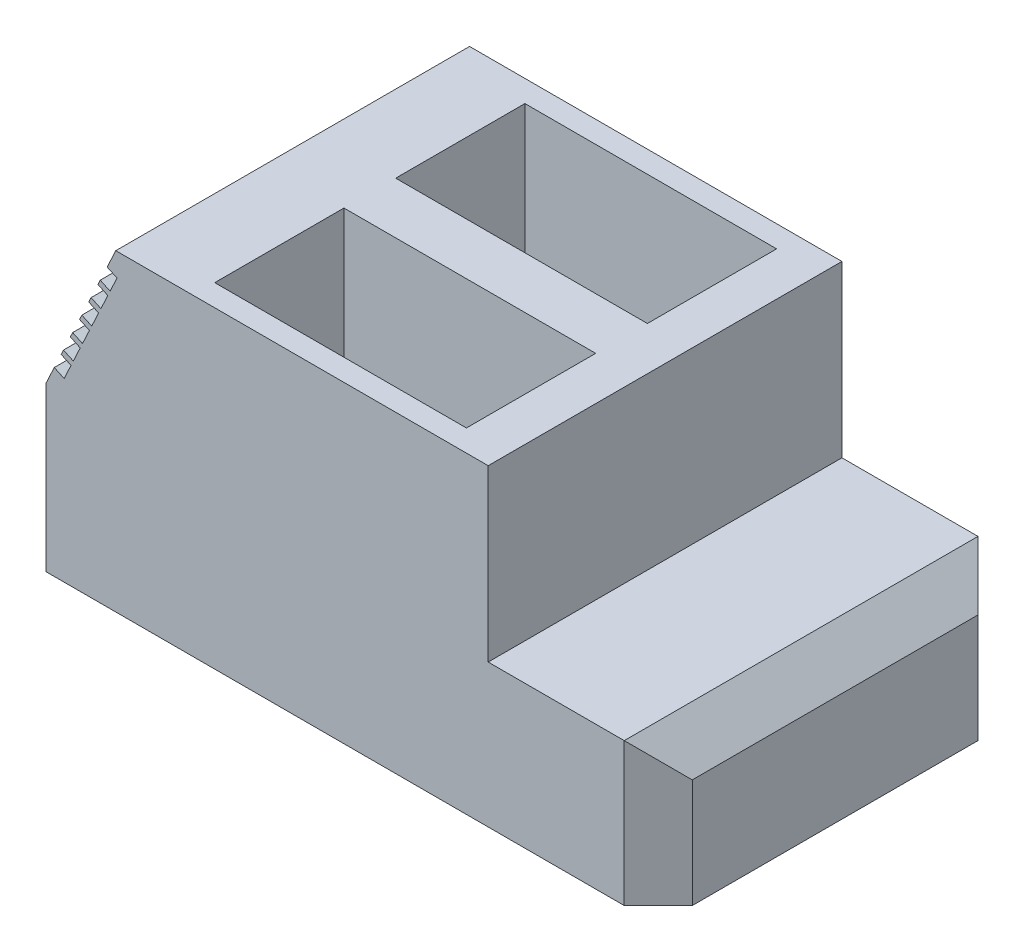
ISO-10303-21;
HEADER;
FILE_DESCRIPTION(('STEP AP214'),'2;1');
FILE_NAME('part.step','',(''),(''),'','','');
FILE_SCHEMA(('AUTOMOTIVE_DESIGN { 1 0 10303 214 1 1 1 1 }'));
ENDSEC;
DATA;
#1=APPLICATION_CONTEXT('core data for automotive mechanical design processes');
#2=APPLICATION_PROTOCOL_DEFINITION('international standard','automotive_design',2000,#1);
#3=PRODUCT_CONTEXT('',#1,'mechanical');
#4=PRODUCT('Part','Part','',(#3));
#5=PRODUCT_RELATED_PRODUCT_CATEGORY('part','',(#4));
#6=PRODUCT_DEFINITION_FORMATION('','',#4);
#7=PRODUCT_DEFINITION_CONTEXT('part definition',#1,'design');
#8=PRODUCT_DEFINITION('design','',#6,#7);
#9=PRODUCT_DEFINITION_SHAPE('','',#8);
#10=(LENGTH_UNIT() NAMED_UNIT(*) SI_UNIT(.MILLI.,.METRE.));
#11=(NAMED_UNIT(*) PLANE_ANGLE_UNIT() SI_UNIT($,.RADIAN.));
#12=(NAMED_UNIT(*) SI_UNIT($,.STERADIAN.) SOLID_ANGLE_UNIT());
#13=UNCERTAINTY_MEASURE_WITH_UNIT(LENGTH_MEASURE(1.E-05),#10,'distance_accuracy_value','');
#14=(GEOMETRIC_REPRESENTATION_CONTEXT(3) GLOBAL_UNCERTAINTY_ASSIGNED_CONTEXT((#13)) GLOBAL_UNIT_ASSIGNED_CONTEXT((#10,
#11,#12)) REPRESENTATION_CONTEXT('',''));
#15=CARTESIAN_POINT('',(0.,0.,0.));
#16=DIRECTION('',(0.,0.,1.));
#17=DIRECTION('',(1.,0.,0.));
#18=AXIS2_PLACEMENT_3D('',#15,#16,#17);
#19=CARTESIAN_POINT('',(-225.,120.,130.));
#20=DIRECTION('',(0.906307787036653,-0.422618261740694,0.));
#21=DIRECTION('',(0.422618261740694,0.906307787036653,0.));
#22=AXIS2_PLACEMENT_3D('',#19,#20,#21);
#23=PLANE('',#22);
#24=DIRECTION('',(0.,0.,-1.));
#25=VECTOR('',#24,1.);
#26=CARTESIAN_POINT('',(-191.878742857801,191.028765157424,-50.));
#27=LINE('',#26,#25);
#28=CARTESIAN_POINT('',(-191.878742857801,191.028765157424,-50.));
#29=VERTEX_POINT('',#28);
#30=CARTESIAN_POINT('',(-191.878742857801,191.028765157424,-130.));
#31=VERTEX_POINT('',#30);
#32=EDGE_CURVE('E697',#29,#31,#27,.T.);
#33=ORIENTED_EDGE('',*,*,#32,.T.);
#34=DIRECTION('',(-0.422618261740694,-0.906307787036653,0.));
#35=VECTOR('',#34,1.);
#36=CARTESIAN_POINT('',(-225.,120.,-130.));
#37=LINE('',#36,#35);
#38=CARTESIAN_POINT('',(-193.569215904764,187.403534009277,-130.));
#39=VERTEX_POINT('',#38);
#40=EDGE_CURVE('E1169',#31,#39,#37,.T.);
#41=ORIENTED_EDGE('',*,*,#40,.T.);
#42=DIRECTION('',(0.,0.,-1.));
#43=VECTOR('',#42,1.);
#44=CARTESIAN_POINT('',(-193.569215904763,187.403534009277,-50.));
#45=LINE('',#44,#43);
#46=CARTESIAN_POINT('',(-193.569215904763,187.403534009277,-50.));
#47=VERTEX_POINT('',#46);
#48=EDGE_CURVE('E582',#47,#39,#45,.T.);
#49=ORIENTED_EDGE('',*,*,#48,.F.);
#50=DIRECTION('',(-0.422618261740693,-0.906307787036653,0.));
#51=VECTOR('',#50,1.);
#52=CARTESIAN_POINT('',(-198.640635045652,176.527840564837,-50.));
#53=LINE('',#52,#51);
#54=CARTESIAN_POINT('',(-198.640635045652,176.527840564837,-50.));
#55=VERTEX_POINT('',#54);
#56=EDGE_CURVE('E572',#47,#55,#53,.T.);
#57=ORIENTED_EDGE('',*,*,#56,.T.);
#58=DIRECTION('',(0.,0.,-1.));
#59=VECTOR('',#58,1.);
#60=CARTESIAN_POINT('',(-198.640635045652,176.527840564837,-50.));
#61=LINE('',#60,#59);
#62=CARTESIAN_POINT('',(-198.640635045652,176.527840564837,-130.));
#63=VERTEX_POINT('',#62);
#64=EDGE_CURVE('E592',#55,#63,#61,.T.);
#65=ORIENTED_EDGE('',*,*,#64,.T.);
#66=CARTESIAN_POINT('',(-200.331108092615,172.902609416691,-130.));
#67=VERTEX_POINT('',#66);
#68=EDGE_CURVE('E1172',#63,#67,#37,.T.);
#69=ORIENTED_EDGE('',*,*,#68,.T.);
#70=DIRECTION('',(0.,0.,-1.));
#71=VECTOR('',#70,1.);
#72=CARTESIAN_POINT('',(-200.331108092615,172.902609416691,-50.));
#73=LINE('',#72,#71);
#74=CARTESIAN_POINT('',(-200.331108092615,172.902609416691,-50.));
#75=VERTEX_POINT('',#74);
#76=EDGE_CURVE('E611',#75,#67,#73,.T.);
#77=ORIENTED_EDGE('',*,*,#76,.F.);
#78=DIRECTION('',(-0.422618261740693,-0.906307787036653,0.));
#79=VECTOR('',#78,1.);
#80=CARTESIAN_POINT('',(-205.402527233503,162.026915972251,-50.));
#81=LINE('',#80,#79);
#82=CARTESIAN_POINT('',(-205.402527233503,162.026915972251,-50.));
#83=VERTEX_POINT('',#82);
#84=EDGE_CURVE('E601',#75,#83,#81,.T.);
#85=ORIENTED_EDGE('',*,*,#84,.T.);
#86=DIRECTION('',(0.,0.,-1.));
#87=VECTOR('',#86,1.);
#88=CARTESIAN_POINT('',(-205.402527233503,162.026915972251,-50.));
#89=LINE('',#88,#87);
#90=CARTESIAN_POINT('',(-205.402527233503,162.026915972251,-130.));
#91=VERTEX_POINT('',#90);
#92=EDGE_CURVE('E587',#83,#91,#89,.T.);
#93=ORIENTED_EDGE('',*,*,#92,.T.);
#94=CARTESIAN_POINT('',(-207.093000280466,158.401684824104,-130.));
#95=VERTEX_POINT('',#94);
#96=EDGE_CURVE('E1174',#91,#95,#37,.T.);
#97=ORIENTED_EDGE('',*,*,#96,.T.);
#98=DIRECTION('',(0.,0.,-1.));
#99=VECTOR('',#98,1.);
#100=CARTESIAN_POINT('',(-207.093000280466,158.401684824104,-50.));
#101=LINE('',#100,#99);
#102=CARTESIAN_POINT('',(-207.093000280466,158.401684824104,-50.));
#103=VERTEX_POINT('',#102);
#104=EDGE_CURVE('E638',#103,#95,#101,.T.);
#105=ORIENTED_EDGE('',*,*,#104,.F.);
#106=DIRECTION('',(-0.422618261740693,-0.906307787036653,0.));
#107=VECTOR('',#106,1.);
#108=CARTESIAN_POINT('',(-212.164419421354,147.525991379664,-50.));
#109=LINE('',#108,#107);
#110=CARTESIAN_POINT('',(-212.164419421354,147.525991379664,-50.));
#111=VERTEX_POINT('',#110);
#112=EDGE_CURVE('E628',#103,#111,#109,.T.);
#113=ORIENTED_EDGE('',*,*,#112,.T.);
#114=DIRECTION('',(0.,0.,-1.));
#115=VECTOR('',#114,1.);
#116=CARTESIAN_POINT('',(-212.164419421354,147.525991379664,-50.));
#117=LINE('',#116,#115);
#118=CARTESIAN_POINT('',(-212.164419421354,147.525991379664,-130.));
#119=VERTEX_POINT('',#118);
#120=EDGE_CURVE('E616',#111,#119,#117,.T.);
#121=ORIENTED_EDGE('',*,*,#120,.T.);
#122=CARTESIAN_POINT('',(-213.854892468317,143.900760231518,-130.));
#123=VERTEX_POINT('',#122);
#124=EDGE_CURVE('E1178',#119,#123,#37,.T.);
#125=ORIENTED_EDGE('',*,*,#124,.T.);
#126=DIRECTION('',(0.,0.,-1.));
#127=VECTOR('',#126,1.);
#128=CARTESIAN_POINT('',(-213.854892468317,143.900760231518,-50.));
#129=LINE('',#128,#127);
#130=CARTESIAN_POINT('',(-213.854892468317,143.900760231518,-50.));
#131=VERTEX_POINT('',#130);
#132=EDGE_CURVE('E665',#131,#123,#129,.T.);
#133=ORIENTED_EDGE('',*,*,#132,.F.);
#134=DIRECTION('',(-0.422618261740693,-0.906307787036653,0.));
#135=VECTOR('',#134,1.);
#136=CARTESIAN_POINT('',(-218.926311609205,133.025066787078,-50.));
#137=LINE('',#136,#135);
#138=CARTESIAN_POINT('',(-218.926311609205,133.025066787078,-50.));
#139=VERTEX_POINT('',#138);
#140=EDGE_CURVE('E655',#131,#139,#137,.T.);
#141=ORIENTED_EDGE('',*,*,#140,.T.);
#142=DIRECTION('',(0.,0.,-1.));
#143=VECTOR('',#142,1.);
#144=CARTESIAN_POINT('',(-218.926311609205,133.025066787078,-50.));
#145=LINE('',#144,#143);
#146=CARTESIAN_POINT('',(-218.926311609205,133.025066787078,-130.));
#147=VERTEX_POINT('',#146);
#148=EDGE_CURVE('E643',#139,#147,#145,.T.);
#149=ORIENTED_EDGE('',*,*,#148,.T.);
#150=CARTESIAN_POINT('',(-225.,120.,-130.));
#151=VERTEX_POINT('',#150);
#152=EDGE_CURVE('E974',#147,#151,#37,.T.);
#153=ORIENTED_EDGE('',*,*,#152,.T.);
#154=DIRECTION('',(0.,0.,-1.));
#155=VECTOR('',#154,1.);
#156=CARTESIAN_POINT('',(-225.,120.,130.));
#157=LINE('',#156,#155);
#158=CARTESIAN_POINT('',(-225.,120.,130.));
#159=VERTEX_POINT('',#158);
#160=EDGE_CURVE('E987',#159,#151,#157,.T.);
#161=ORIENTED_EDGE('',*,*,#160,.F.);
#162=DIRECTION('',(-0.422618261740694,-0.906307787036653,0.));
#163=VECTOR('',#162,1.);
#164=CARTESIAN_POINT('',(-225.,120.,130.));
#165=LINE('',#164,#163);
#166=CARTESIAN_POINT('',(-218.926311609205,133.025066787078,130.));
#167=VERTEX_POINT('',#166);
#168=EDGE_CURVE('E958',#167,#159,#165,.T.);
#169=ORIENTED_EDGE('',*,*,#168,.F.);
#170=DIRECTION('',(0.,0.,1.));
#171=VECTOR('',#170,1.);
#172=CARTESIAN_POINT('',(-218.926311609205,133.025066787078,50.));
#173=LINE('',#172,#171);
#174=CARTESIAN_POINT('',(-218.926311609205,133.025066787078,50.));
#175=VERTEX_POINT('',#174);
#176=EDGE_CURVE('E843',#175,#167,#173,.T.);
#177=ORIENTED_EDGE('',*,*,#176,.F.);
#178=DIRECTION('',(-0.422618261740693,-0.906307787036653,0.));
#179=VECTOR('',#178,1.);
#180=CARTESIAN_POINT('',(-218.926311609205,133.025066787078,50.));
#181=LINE('',#180,#179);
#182=CARTESIAN_POINT('',(-213.854892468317,143.900760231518,50.));
#183=VERTEX_POINT('',#182);
#184=EDGE_CURVE('E830',#183,#175,#181,.T.);
#185=ORIENTED_EDGE('',*,*,#184,.F.);
#186=DIRECTION('',(0.,0.,1.));
#187=VECTOR('',#186,1.);
#188=CARTESIAN_POINT('',(-213.854892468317,143.900760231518,50.));
#189=LINE('',#188,#187);
#190=CARTESIAN_POINT('',(-213.854892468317,143.900760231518,130.));
#191=VERTEX_POINT('',#190);
#192=EDGE_CURVE('E819',#183,#191,#189,.T.);
#193=ORIENTED_EDGE('',*,*,#192,.T.);
#194=CARTESIAN_POINT('',(-212.164419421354,147.525991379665,130.));
#195=VERTEX_POINT('',#194);
#196=EDGE_CURVE('E1263',#195,#191,#165,.T.);
#197=ORIENTED_EDGE('',*,*,#196,.F.);
#198=DIRECTION('',(0.,0.,1.));
#199=VECTOR('',#198,1.);
#200=CARTESIAN_POINT('',(-212.164419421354,147.525991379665,50.));
#201=LINE('',#200,#199);
#202=CARTESIAN_POINT('',(-212.164419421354,147.525991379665,50.));
#203=VERTEX_POINT('',#202);
#204=EDGE_CURVE('E814',#203,#195,#201,.T.);
#205=ORIENTED_EDGE('',*,*,#204,.F.);
#206=DIRECTION('',(-0.422618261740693,-0.906307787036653,0.));
#207=VECTOR('',#206,1.);
#208=CARTESIAN_POINT('',(-212.164419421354,147.525991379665,50.));
#209=LINE('',#208,#207);
#210=CARTESIAN_POINT('',(-207.093000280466,158.401684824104,50.));
#211=VERTEX_POINT('',#210);
#212=EDGE_CURVE('E801',#211,#203,#209,.T.);
#213=ORIENTED_EDGE('',*,*,#212,.F.);
#214=DIRECTION('',(0.,0.,1.));
#215=VECTOR('',#214,1.);
#216=CARTESIAN_POINT('',(-207.093000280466,158.401684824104,50.));
#217=LINE('',#216,#215);
#218=CARTESIAN_POINT('',(-207.093000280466,158.401684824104,130.));
#219=VERTEX_POINT('',#218);
#220=EDGE_CURVE('E790',#211,#219,#217,.T.);
#221=ORIENTED_EDGE('',*,*,#220,.T.);
#222=CARTESIAN_POINT('',(-205.402527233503,162.026915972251,130.));
#223=VERTEX_POINT('',#222);
#224=EDGE_CURVE('E1258',#223,#219,#165,.T.);
#225=ORIENTED_EDGE('',*,*,#224,.F.);
#226=DIRECTION('',(0.,0.,1.));
#227=VECTOR('',#226,1.);
#228=CARTESIAN_POINT('',(-205.402527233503,162.026915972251,50.));
#229=LINE('',#228,#227);
#230=CARTESIAN_POINT('',(-205.402527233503,162.026915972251,50.));
#231=VERTEX_POINT('',#230);
#232=EDGE_CURVE('E785',#231,#223,#229,.T.);
#233=ORIENTED_EDGE('',*,*,#232,.F.);
#234=DIRECTION('',(-0.422618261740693,-0.906307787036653,0.));
#235=VECTOR('',#234,1.);
#236=CARTESIAN_POINT('',(-205.402527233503,162.026915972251,50.));
#237=LINE('',#236,#235);
#238=CARTESIAN_POINT('',(-200.331108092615,172.902609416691,50.));
#239=VERTEX_POINT('',#238);
#240=EDGE_CURVE('E772',#239,#231,#237,.T.);
#241=ORIENTED_EDGE('',*,*,#240,.F.);
#242=DIRECTION('',(0.,0.,1.));
#243=VECTOR('',#242,1.);
#244=CARTESIAN_POINT('',(-200.331108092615,172.902609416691,50.));
#245=LINE('',#244,#243);
#246=CARTESIAN_POINT('',(-200.331108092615,172.902609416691,130.));
#247=VERTEX_POINT('',#246);
#248=EDGE_CURVE('E759',#239,#247,#245,.T.);
#249=ORIENTED_EDGE('',*,*,#248,.T.);
#250=CARTESIAN_POINT('',(-198.640635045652,176.527840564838,130.));
#251=VERTEX_POINT('',#250);
#252=EDGE_CURVE('E1253',#251,#247,#165,.T.);
#253=ORIENTED_EDGE('',*,*,#252,.F.);
#254=DIRECTION('',(0.,0.,1.));
#255=VECTOR('',#254,1.);
#256=CARTESIAN_POINT('',(-198.640635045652,176.527840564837,50.));
#257=LINE('',#256,#255);
#258=CARTESIAN_POINT('',(-198.640635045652,176.527840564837,50.));
#259=VERTEX_POINT('',#258);
#260=EDGE_CURVE('E754',#259,#251,#257,.T.);
#261=ORIENTED_EDGE('',*,*,#260,.F.);
#262=DIRECTION('',(-0.422618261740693,-0.906307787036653,0.));
#263=VECTOR('',#262,1.);
#264=CARTESIAN_POINT('',(-198.640635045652,176.527840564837,50.));
#265=LINE('',#264,#263);
#266=CARTESIAN_POINT('',(-193.569215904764,187.403534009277,50.));
#267=VERTEX_POINT('',#266);
#268=EDGE_CURVE('E741',#267,#259,#265,.T.);
#269=ORIENTED_EDGE('',*,*,#268,.F.);
#270=DIRECTION('',(0.,0.,1.));
#271=VECTOR('',#270,1.);
#272=CARTESIAN_POINT('',(-193.569215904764,187.403534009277,50.));
#273=LINE('',#272,#271);
#274=CARTESIAN_POINT('',(-193.569215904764,187.403534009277,130.));
#275=VERTEX_POINT('',#274);
#276=EDGE_CURVE('E763',#267,#275,#273,.T.);
#277=ORIENTED_EDGE('',*,*,#276,.T.);
#278=CARTESIAN_POINT('',(-191.878742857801,191.028765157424,130.));
#279=VERTEX_POINT('',#278);
#280=EDGE_CURVE('E1251',#279,#275,#165,.T.);
#281=ORIENTED_EDGE('',*,*,#280,.F.);
#282=DIRECTION('',(0.,0.,1.));
#283=VECTOR('',#282,1.);
#284=CARTESIAN_POINT('',(-191.878742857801,191.028765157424,50.));
#285=LINE('',#284,#283);
#286=CARTESIAN_POINT('',(-191.878742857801,191.028765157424,50.));
#287=VERTEX_POINT('',#286);
#288=EDGE_CURVE('E870',#287,#279,#285,.T.);
#289=ORIENTED_EDGE('',*,*,#288,.F.);
#290=DIRECTION('',(-0.422618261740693,-0.906307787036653,0.));
#291=VECTOR('',#290,1.);
#292=CARTESIAN_POINT('',(-191.878742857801,191.028765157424,50.));
#293=LINE('',#292,#291);
#294=CARTESIAN_POINT('',(-186.807323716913,201.904458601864,50.));
#295=VERTEX_POINT('',#294);
#296=EDGE_CURVE('E857',#295,#287,#293,.T.);
#297=ORIENTED_EDGE('',*,*,#296,.F.);
#298=DIRECTION('',(0.,0.,1.));
#299=VECTOR('',#298,1.);
#300=CARTESIAN_POINT('',(-186.807323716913,201.904458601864,50.));
#301=LINE('',#300,#299);
#302=CARTESIAN_POINT('',(-186.807323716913,201.904458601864,130.));
#303=VERTEX_POINT('',#302);
#304=EDGE_CURVE('E877',#295,#303,#301,.T.);
#305=ORIENTED_EDGE('',*,*,#304,.T.);
#306=CARTESIAN_POINT('',(-185.11685066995,205.52968975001,130.));
#307=VERTEX_POINT('',#306);
#308=EDGE_CURVE('E963',#307,#303,#165,.T.);
#309=ORIENTED_EDGE('',*,*,#308,.F.);
#310=DIRECTION('',(0.,0.,1.));
#311=VECTOR('',#310,1.);
#312=CARTESIAN_POINT('',(-185.11685066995,205.52968975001,50.));
#313=LINE('',#312,#311);
#314=CARTESIAN_POINT('',(-185.11685066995,205.52968975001,50.));
#315=VERTEX_POINT('',#314);
#316=EDGE_CURVE('E899',#315,#307,#313,.T.);
#317=ORIENTED_EDGE('',*,*,#316,.F.);
#318=DIRECTION('',(-0.422618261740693,-0.906307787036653,0.));
#319=VECTOR('',#318,1.);
#320=CARTESIAN_POINT('',(-185.11685066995,205.52968975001,50.));
#321=LINE('',#320,#319);
#322=CARTESIAN_POINT('',(-180.045431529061,216.40538319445,50.));
#323=VERTEX_POINT('',#322);
#324=EDGE_CURVE('E886',#323,#315,#321,.T.);
#325=ORIENTED_EDGE('',*,*,#324,.F.);
#326=DIRECTION('',(0.,0.,1.));
#327=VECTOR('',#326,1.);
#328=CARTESIAN_POINT('',(-180.045431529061,216.40538319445,50.));
#329=LINE('',#328,#327);
#330=CARTESIAN_POINT('',(-180.045431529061,216.40538319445,130.));
#331=VERTEX_POINT('',#330);
#332=EDGE_CURVE('E906',#323,#331,#329,.T.);
#333=ORIENTED_EDGE('',*,*,#332,.T.);
#334=CARTESIAN_POINT('',(-173.706157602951,230.,130.));
#335=VERTEX_POINT('',#334);
#336=EDGE_CURVE('E959',#335,#331,#165,.T.);
#337=ORIENTED_EDGE('',*,*,#336,.F.);
#338=DIRECTION('',(0.,0.,-1.));
#339=VECTOR('',#338,1.);
#340=CARTESIAN_POINT('',(-173.706157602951,230.,130.));
#341=LINE('',#340,#339);
#342=CARTESIAN_POINT('',(-173.706157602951,230.,-130.));
#343=VERTEX_POINT('',#342);
#344=EDGE_CURVE('E990',#335,#343,#341,.T.);
#345=ORIENTED_EDGE('',*,*,#344,.T.);
#346=CARTESIAN_POINT('',(-180.045431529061,216.40538319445,-130.));
#347=VERTEX_POINT('',#346);
#348=EDGE_CURVE('E975',#343,#347,#37,.T.);
#349=ORIENTED_EDGE('',*,*,#348,.T.);
#350=DIRECTION('',(0.,0.,-1.));
#351=VECTOR('',#350,1.);
#352=CARTESIAN_POINT('',(-180.045431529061,216.40538319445,-50.));
#353=LINE('',#352,#351);
#354=CARTESIAN_POINT('',(-180.045431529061,216.40538319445,-50.));
#355=VERTEX_POINT('',#354);
#356=EDGE_CURVE('E692',#355,#347,#353,.T.);
#357=ORIENTED_EDGE('',*,*,#356,.F.);
#358=DIRECTION('',(-0.422618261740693,-0.906307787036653,0.));
#359=VECTOR('',#358,1.);
#360=CARTESIAN_POINT('',(-185.11685066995,205.52968975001,-50.));
#361=LINE('',#360,#359);
#362=CARTESIAN_POINT('',(-185.11685066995,205.52968975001,-50.));
#363=VERTEX_POINT('',#362);
#364=EDGE_CURVE('E682',#355,#363,#361,.T.);
#365=ORIENTED_EDGE('',*,*,#364,.T.);
#366=DIRECTION('',(0.,0.,-1.));
#367=VECTOR('',#366,1.);
#368=CARTESIAN_POINT('',(-185.11685066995,205.52968975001,-50.));
#369=LINE('',#368,#367);
#370=CARTESIAN_POINT('',(-185.11685066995,205.52968975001,-130.));
#371=VERTEX_POINT('',#370);
#372=EDGE_CURVE('E702',#363,#371,#369,.T.);
#373=ORIENTED_EDGE('',*,*,#372,.T.);
#374=CARTESIAN_POINT('',(-186.807323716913,201.904458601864,-130.));
#375=VERTEX_POINT('',#374);
#376=EDGE_CURVE('E565',#371,#375,#37,.T.);
#377=ORIENTED_EDGE('',*,*,#376,.T.);
#378=DIRECTION('',(0.,0.,-1.));
#379=VECTOR('',#378,1.);
#380=CARTESIAN_POINT('',(-186.807323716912,201.904458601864,-50.));
#381=LINE('',#380,#379);
#382=CARTESIAN_POINT('',(-186.807323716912,201.904458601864,-50.));
#383=VERTEX_POINT('',#382);
#384=EDGE_CURVE('E546',#383,#375,#381,.T.);
#385=ORIENTED_EDGE('',*,*,#384,.F.);
#386=DIRECTION('',(-0.422618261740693,-0.906307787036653,0.));
#387=VECTOR('',#386,1.);
#388=CARTESIAN_POINT('',(-191.878742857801,191.028765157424,-50.));
#389=LINE('',#388,#387);
#390=EDGE_CURVE('E552',#383,#29,#389,.T.);
#391=ORIENTED_EDGE('',*,*,#390,.T.);
#392=EDGE_LOOP('',(#33,#41,#49,#57,#65,#69,#77,#85,#93,#97,#105,#113,#121,#125,#133,#141,#149,
#153,#161,#169,#177,#185,#193,#197,#205,#213,#221,#225,#233,#241,#249,#253,#261,#269,#277,#281,
#289,#297,#305,#309,#317,#325,#333,#337,#345,#349,#357,#365,#373,#377,#385,#391));
#393=FACE_BOUND('',#392,.T.);
#394=ADVANCED_FACE('F39',(#393),#23,.F.);
#395=CARTESIAN_POINT('',(0.,0.,-130.));
#396=DIRECTION('',(0.,0.,1.));
#397=DIRECTION('',(1.,0.,0.));
#398=AXIS2_PLACEMENT_3D('',#395,#396,#397);
#399=PLANE('',#398);
#400=DIRECTION('',(-1.,0.,0.));
#401=VECTOR('',#400,1.);
#402=CARTESIAN_POINT('',(100.,105.,-130.));
#403=LINE('',#402,#401);
#404=CARTESIAN_POINT('',(200.,105.,-130.));
#405=VERTEX_POINT('',#404);
#406=CARTESIAN_POINT('',(100.,105.,-130.));
#407=VERTEX_POINT('',#406);
#408=EDGE_CURVE('E942',#405,#407,#403,.T.);
#409=ORIENTED_EDGE('',*,*,#408,.F.);
#410=DIRECTION('',(0.,-1.,0.));
#411=VECTOR('',#410,1.);
#412=CARTESIAN_POINT('',(200.,0.,-130.));
#413=LINE('',#412,#411);
#414=CARTESIAN_POINT('',(200.,0.,-130.));
#415=VERTEX_POINT('',#414);
#416=EDGE_CURVE('E1006',#405,#415,#413,.T.);
#417=ORIENTED_EDGE('',*,*,#416,.T.);
#418=DIRECTION('',(1.,0.,0.));
#419=VECTOR('',#418,1.);
#420=CARTESIAN_POINT('',(-225.,0.,-130.));
#421=LINE('',#420,#419);
#422=CARTESIAN_POINT('',(-225.,0.,-130.));
#423=VERTEX_POINT('',#422);
#424=EDGE_CURVE('E953',#423,#415,#421,.T.);
#425=ORIENTED_EDGE('',*,*,#424,.F.);
#426=DIRECTION('',(0.,-1.,0.));
#427=VECTOR('',#426,1.);
#428=CARTESIAN_POINT('',(-225.,120.,-130.));
#429=LINE('',#428,#427);
#430=EDGE_CURVE('E978',#151,#423,#429,.T.);
#431=ORIENTED_EDGE('',*,*,#430,.F.);
#432=ORIENTED_EDGE('',*,*,#152,.F.);
#433=DIRECTION('',(0.906307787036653,-0.422618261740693,0.));
#434=VECTOR('',#433,1.);
#435=CARTESIAN_POINT('',(-211.675849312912,129.644120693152,-130.));
#436=LINE('',#435,#434);
#437=CARTESIAN_POINT('',(-211.675849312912,129.644120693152,-130.));
#438=VERTEX_POINT('',#437);
#439=EDGE_CURVE('E659',#147,#438,#436,.T.);
#440=ORIENTED_EDGE('',*,*,#439,.T.);
#441=DIRECTION('',(0.422618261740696,0.906307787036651,0.));
#442=VECTOR('',#441,1.);
#443=CARTESIAN_POINT('',(-206.604430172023,140.519814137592,-130.));
#444=LINE('',#443,#442);
#445=CARTESIAN_POINT('',(-206.604430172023,140.519814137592,-130.));
#446=VERTEX_POINT('',#445);
#447=EDGE_CURVE('E669',#438,#446,#444,.T.);
#448=ORIENTED_EDGE('',*,*,#447,.T.);
#449=DIRECTION('',(-0.906307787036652,0.422618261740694,0.));
#450=VECTOR('',#449,1.);
#451=CARTESIAN_POINT('',(-213.854892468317,143.900760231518,-130.));
#452=LINE('',#451,#450);
#453=EDGE_CURVE('E666',#446,#123,#452,.T.);
#454=ORIENTED_EDGE('',*,*,#453,.T.);
#455=ORIENTED_EDGE('',*,*,#124,.F.);
#456=DIRECTION('',(0.906307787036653,-0.422618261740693,0.));
#457=VECTOR('',#456,1.);
#458=CARTESIAN_POINT('',(-204.913957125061,144.145045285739,-130.));
#459=LINE('',#458,#457);
#460=CARTESIAN_POINT('',(-204.913957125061,144.145045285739,-130.));
#461=VERTEX_POINT('',#460);
#462=EDGE_CURVE('E632',#119,#461,#459,.T.);
#463=ORIENTED_EDGE('',*,*,#462,.T.);
#464=DIRECTION('',(0.422618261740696,0.906307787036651,0.));
#465=VECTOR('',#464,1.);
#466=CARTESIAN_POINT('',(-199.842537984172,155.020738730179,-130.));
#467=LINE('',#466,#465);
#468=CARTESIAN_POINT('',(-199.842537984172,155.020738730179,-130.));
#469=VERTEX_POINT('',#468);
#470=EDGE_CURVE('E642',#461,#469,#467,.T.);
#471=ORIENTED_EDGE('',*,*,#470,.T.);
#472=DIRECTION('',(-0.906307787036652,0.422618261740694,0.));
#473=VECTOR('',#472,1.);
#474=CARTESIAN_POINT('',(-207.093000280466,158.401684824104,-130.));
#475=LINE('',#474,#473);
#476=EDGE_CURVE('E639',#469,#95,#475,.T.);
#477=ORIENTED_EDGE('',*,*,#476,.T.);
#478=ORIENTED_EDGE('',*,*,#96,.F.);
#479=DIRECTION('',(0.906307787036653,-0.422618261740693,0.));
#480=VECTOR('',#479,1.);
#481=CARTESIAN_POINT('',(-198.15206493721,158.645969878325,-130.));
#482=LINE('',#481,#480);
#483=CARTESIAN_POINT('',(-198.15206493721,158.645969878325,-130.));
#484=VERTEX_POINT('',#483);
#485=EDGE_CURVE('E605',#91,#484,#482,.T.);
#486=ORIENTED_EDGE('',*,*,#485,.T.);
#487=DIRECTION('',(0.422618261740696,0.906307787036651,0.));
#488=VECTOR('',#487,1.);
#489=CARTESIAN_POINT('',(-193.080645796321,169.521663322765,-130.));
#490=LINE('',#489,#488);
#491=CARTESIAN_POINT('',(-193.080645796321,169.521663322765,-130.));
#492=VERTEX_POINT('',#491);
#493=EDGE_CURVE('E615',#484,#492,#490,.T.);
#494=ORIENTED_EDGE('',*,*,#493,.T.);
#495=DIRECTION('',(-0.906307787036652,0.422618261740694,0.));
#496=VECTOR('',#495,1.);
#497=CARTESIAN_POINT('',(-200.331108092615,172.902609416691,-130.));
#498=LINE('',#497,#496);
#499=EDGE_CURVE('E612',#492,#67,#498,.T.);
#500=ORIENTED_EDGE('',*,*,#499,.T.);
#501=ORIENTED_EDGE('',*,*,#68,.F.);
#502=DIRECTION('',(0.906307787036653,-0.422618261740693,0.));
#503=VECTOR('',#502,1.);
#504=CARTESIAN_POINT('',(-191.390172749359,173.146894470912,-130.));
#505=LINE('',#504,#503);
#506=CARTESIAN_POINT('',(-191.390172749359,173.146894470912,-130.));
#507=VERTEX_POINT('',#506);
#508=EDGE_CURVE('E576',#63,#507,#505,.T.);
#509=ORIENTED_EDGE('',*,*,#508,.T.);
#510=DIRECTION('',(0.422618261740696,0.906307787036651,0.));
#511=VECTOR('',#510,1.);
#512=CARTESIAN_POINT('',(-186.31875360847,184.022587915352,-130.));
#513=LINE('',#512,#511);
#514=CARTESIAN_POINT('',(-186.31875360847,184.022587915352,-130.));
#515=VERTEX_POINT('',#514);
#516=EDGE_CURVE('E586',#507,#515,#513,.T.);
#517=ORIENTED_EDGE('',*,*,#516,.T.);
#518=DIRECTION('',(-0.906307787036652,0.422618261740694,0.));
#519=VECTOR('',#518,1.);
#520=CARTESIAN_POINT('',(-193.569215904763,187.403534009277,-130.));
#521=LINE('',#520,#519);
#522=EDGE_CURVE('E583',#515,#39,#521,.T.);
#523=ORIENTED_EDGE('',*,*,#522,.T.);
#524=ORIENTED_EDGE('',*,*,#40,.F.);
#525=DIRECTION('',(0.906307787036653,-0.422618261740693,0.));
#526=VECTOR('',#525,1.);
#527=CARTESIAN_POINT('',(-184.628280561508,187.647819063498,-130.));
#528=LINE('',#527,#526);
#529=CARTESIAN_POINT('',(-184.628280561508,187.647819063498,-130.));
#530=VERTEX_POINT('',#529);
#531=EDGE_CURVE('E560',#31,#530,#528,.T.);
#532=ORIENTED_EDGE('',*,*,#531,.T.);
#533=DIRECTION('',(0.422618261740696,0.906307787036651,0.));
#534=VECTOR('',#533,1.);
#535=CARTESIAN_POINT('',(-179.556861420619,198.523512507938,-130.));
#536=LINE('',#535,#534);
#537=CARTESIAN_POINT('',(-179.556861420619,198.523512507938,-130.));
#538=VERTEX_POINT('',#537);
#539=EDGE_CURVE('E1153',#530,#538,#536,.T.);
#540=ORIENTED_EDGE('',*,*,#539,.T.);
#541=DIRECTION('',(-0.906307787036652,0.422618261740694,0.));
#542=VECTOR('',#541,1.);
#543=CARTESIAN_POINT('',(-186.807323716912,201.904458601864,-130.));
#544=LINE('',#543,#542);
#545=EDGE_CURVE('E595',#538,#375,#544,.T.);
#546=ORIENTED_EDGE('',*,*,#545,.T.);
#547=ORIENTED_EDGE('',*,*,#376,.F.);
#548=DIRECTION('',(0.906307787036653,-0.422618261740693,0.));
#549=VECTOR('',#548,1.);
#550=CARTESIAN_POINT('',(-177.866388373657,202.148743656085,-130.));
#551=LINE('',#550,#549);
#552=CARTESIAN_POINT('',(-177.866388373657,202.148743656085,-130.));
#553=VERTEX_POINT('',#552);
#554=EDGE_CURVE('E686',#371,#553,#551,.T.);
#555=ORIENTED_EDGE('',*,*,#554,.T.);
#556=DIRECTION('',(0.422618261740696,0.906307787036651,0.));
#557=VECTOR('',#556,1.);
#558=CARTESIAN_POINT('',(-172.794969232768,213.024437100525,-130.));
#559=LINE('',#558,#557);
#560=CARTESIAN_POINT('',(-172.794969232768,213.024437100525,-130.));
#561=VERTEX_POINT('',#560);
#562=EDGE_CURVE('E696',#553,#561,#559,.T.);
#563=ORIENTED_EDGE('',*,*,#562,.T.);
#564=DIRECTION('',(-0.906307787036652,0.422618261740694,0.));
#565=VECTOR('',#564,1.);
#566=CARTESIAN_POINT('',(-180.045431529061,216.40538319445,-130.));
#567=LINE('',#566,#565);
#568=EDGE_CURVE('E693',#561,#347,#567,.T.);
#569=ORIENTED_EDGE('',*,*,#568,.T.);
#570=ORIENTED_EDGE('',*,*,#348,.F.);
#571=DIRECTION('',(-1.,0.,0.));
#572=VECTOR('',#571,1.);
#573=CARTESIAN_POINT('',(-173.706157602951,230.,-130.));
#574=LINE('',#573,#572);
#575=CARTESIAN_POINT('',(100.,230.,-130.));
#576=VERTEX_POINT('',#575);
#577=EDGE_CURVE('E972',#576,#343,#574,.T.);
#578=ORIENTED_EDGE('',*,*,#577,.F.);
#579=DIRECTION('',(0.,1.,0.));
#580=VECTOR('',#579,1.);
#581=CARTESIAN_POINT('',(100.,230.,-130.));
#582=LINE('',#581,#580);
#583=EDGE_CURVE('E970',#407,#576,#582,.T.);
#584=ORIENTED_EDGE('',*,*,#583,.F.);
#585=EDGE_LOOP('',(#409,#417,#425,#431,#432,#440,#448,#454,#455,#463,#471,#477,#478,#486,#494,
#500,#501,#509,#517,#523,#524,#532,#540,#546,#547,#555,#563,#569,#570,#578,#584));
#586=FACE_BOUND('',#585,.T.);
#587=ADVANCED_FACE('F1167',(#586),#399,.F.);
#588=CARTESIAN_POINT('',(-173.706157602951,230.,130.));
#589=DIRECTION('',(0.,-1.,0.));
#590=DIRECTION('',(0.,0.,-1.));
#591=AXIS2_PLACEMENT_3D('',#588,#589,#590);
#592=PLANE('',#591);
#593=ORIENTED_EDGE('',*,*,#577,.T.);
#594=ORIENTED_EDGE('',*,*,#344,.F.);
#595=DIRECTION('',(-1.,0.,0.));
#596=VECTOR('',#595,1.);
#597=CARTESIAN_POINT('',(-173.706157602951,230.,130.));
#598=LINE('',#597,#596);
#599=CARTESIAN_POINT('',(100.,230.,130.));
#600=VERTEX_POINT('',#599);
#601=EDGE_CURVE('E955',#600,#335,#598,.T.);
#602=ORIENTED_EDGE('',*,*,#601,.F.);
#603=DIRECTION('',(0.,0.,-1.));
#604=VECTOR('',#603,1.);
#605=CARTESIAN_POINT('',(100.,230.,130.));
#606=LINE('',#605,#604);
#607=EDGE_CURVE('E993',#600,#576,#606,.T.);
#608=ORIENTED_EDGE('',*,*,#607,.T.);
#609=EDGE_LOOP('',(#593,#594,#602,#608));
#610=FACE_BOUND('',#609,.T.);
#611=DIRECTION('',(1.,0.,0.));
#612=VECTOR('',#611,1.);
#613=CARTESIAN_POINT('',(-117.,230.,114.));
#614=LINE('',#613,#612);
#615=CARTESIAN_POINT('',(-117.,230.,114.));
#616=VERTEX_POINT('',#615);
#617=CARTESIAN_POINT('',(68.,230.,114.));
#618=VERTEX_POINT('',#617);
#619=EDGE_CURVE('E930',#616,#618,#614,.T.);
#620=ORIENTED_EDGE('',*,*,#619,.F.);
#621=DIRECTION('',(0.,0.,1.));
#622=VECTOR('',#621,1.);
#623=CARTESIAN_POINT('',(-117.,230.,19.));
#624=LINE('',#623,#622);
#625=CARTESIAN_POINT('',(-117.,230.,19.));
#626=VERTEX_POINT('',#625);
#627=EDGE_CURVE('E909',#626,#616,#624,.T.);
#628=ORIENTED_EDGE('',*,*,#627,.F.);
#629=DIRECTION('',(-1.,0.,0.));
#630=VECTOR('',#629,1.);
#631=CARTESIAN_POINT('',(-117.,230.,19.));
#632=LINE('',#631,#630);
#633=CARTESIAN_POINT('',(68.,230.,19.));
#634=VERTEX_POINT('',#633);
#635=EDGE_CURVE('E919',#634,#626,#632,.T.);
#636=ORIENTED_EDGE('',*,*,#635,.F.);
#637=DIRECTION('',(0.,0.,-1.));
#638=VECTOR('',#637,1.);
#639=CARTESIAN_POINT('',(68.,230.,19.));
#640=LINE('',#639,#638);
#641=EDGE_CURVE('E934',#618,#634,#640,.T.);
#642=ORIENTED_EDGE('',*,*,#641,.F.);
#643=EDGE_LOOP('',(#620,#628,#636,#642));
#644=FACE_BOUND('',#643,.T.);
#645=DIRECTION('',(0.,0.,-1.));
#646=VECTOR('',#645,1.);
#647=CARTESIAN_POINT('',(-117.,230.,-19.));
#648=LINE('',#647,#646);
#649=CARTESIAN_POINT('',(-117.,230.,-19.));
#650=VERTEX_POINT('',#649);
#651=CARTESIAN_POINT('',(-117.,230.,-114.));
#652=VERTEX_POINT('',#651);
#653=EDGE_CURVE('E704',#650,#652,#648,.T.);
#654=ORIENTED_EDGE('',*,*,#653,.T.);
#655=DIRECTION('',(1.,0.,0.));
#656=VECTOR('',#655,1.);
#657=CARTESIAN_POINT('',(-117.,230.,-114.));
#658=LINE('',#657,#656);
#659=CARTESIAN_POINT('',(68.,230.,-114.));
#660=VERTEX_POINT('',#659);
#661=EDGE_CURVE('E713',#652,#660,#658,.T.);
#662=ORIENTED_EDGE('',*,*,#661,.T.);
#663=DIRECTION('',(0.,0.,1.));
#664=VECTOR('',#663,1.);
#665=CARTESIAN_POINT('',(68.,230.,-19.));
#666=LINE('',#665,#664);
#667=CARTESIAN_POINT('',(68.,230.,-19.));
#668=VERTEX_POINT('',#667);
#669=EDGE_CURVE('E726',#660,#668,#666,.T.);
#670=ORIENTED_EDGE('',*,*,#669,.T.);
#671=DIRECTION('',(-1.,0.,0.));
#672=VECTOR('',#671,1.);
#673=CARTESIAN_POINT('',(-117.,230.,-19.));
#674=LINE('',#673,#672);
#675=EDGE_CURVE('E723',#668,#650,#674,.T.);
#676=ORIENTED_EDGE('',*,*,#675,.T.);
#677=EDGE_LOOP('',(#654,#662,#670,#676));
#678=FACE_BOUND('',#677,.T.);
#679=ADVANCED_FACE('F1230',(#610,#644,#678),#592,.F.);
#680=CARTESIAN_POINT('',(-225.,0.,130.));
#681=DIRECTION('',(0.,1.,0.));
#682=DIRECTION('',(0.,0.,1.));
#683=AXIS2_PLACEMENT_3D('',#680,#681,#682);
#684=PLANE('',#683);
#685=DIRECTION('',(1.,0.,0.));
#686=VECTOR('',#685,1.);
#687=CARTESIAN_POINT('',(-185.,0.,-60.));
#688=LINE('',#687,#686);
#689=CARTESIAN_POINT('',(-173.,0.,-60.));
#690=VERTEX_POINT('',#689);
#691=CARTESIAN_POINT('',(-147.,0.,-60.));
#692=VERTEX_POINT('',#691);
#693=EDGE_CURVE('E1103',#690,#692,#688,.T.);
#694=ORIENTED_EDGE('',*,*,#693,.F.);
#695=CARTESIAN_POINT('',(-173.,0.,-48.));
#696=DIRECTION('',(0.,1.,0.));
#697=DIRECTION('',(0.,0.,1.));
#698=AXIS2_PLACEMENT_3D('',#695,#696,#697);
#699=CIRCLE('',#698,12.);
#700=CARTESIAN_POINT('',(-185.,0.,-48.));
#701=VERTEX_POINT('',#700);
#702=EDGE_CURVE('E47',#690,#701,#699,.T.);
#703=ORIENTED_EDGE('',*,*,#702,.T.);
#704=DIRECTION('',(0.,0.,-1.));
#705=VECTOR('',#704,1.);
#706=CARTESIAN_POINT('',(-185.,0.,60.));
#707=LINE('',#706,#705);
#708=CARTESIAN_POINT('',(-185.,0.,48.));
#709=VERTEX_POINT('',#708);
#710=EDGE_CURVE('E1126',#709,#701,#707,.T.);
#711=ORIENTED_EDGE('',*,*,#710,.F.);
#712=CARTESIAN_POINT('',(-173.,0.,48.));
#713=DIRECTION('',(0.,1.,0.));
#714=DIRECTION('',(0.,0.,1.));
#715=AXIS2_PLACEMENT_3D('',#712,#713,#714);
#716=CIRCLE('',#715,12.);
#717=CARTESIAN_POINT('',(-173.,0.,60.));
#718=VERTEX_POINT('',#717);
#719=EDGE_CURVE('E11',#709,#718,#716,.T.);
#720=ORIENTED_EDGE('',*,*,#719,.T.);
#721=DIRECTION('',(-1.,0.,0.));
#722=VECTOR('',#721,1.);
#723=CARTESIAN_POINT('',(-185.,0.,60.));
#724=LINE('',#723,#722);
#725=CARTESIAN_POINT('',(-147.,0.,60.));
#726=VERTEX_POINT('',#725);
#727=EDGE_CURVE('E1094',#726,#718,#724,.T.);
#728=ORIENTED_EDGE('',*,*,#727,.F.);
#729=CARTESIAN_POINT('',(-147.,0.,48.));
#730=DIRECTION('',(0.,1.,0.));
#731=DIRECTION('',(0.,0.,1.));
#732=AXIS2_PLACEMENT_3D('',#729,#730,#731);
#733=CIRCLE('',#732,12.);
#734=CARTESIAN_POINT('',(-135.,0.,48.));
#735=VERTEX_POINT('',#734);
#736=EDGE_CURVE('E1086',#726,#735,#733,.T.);
#737=ORIENTED_EDGE('',*,*,#736,.T.);
#738=DIRECTION('',(0.,0.,1.));
#739=VECTOR('',#738,1.);
#740=CARTESIAN_POINT('',(-135.,0.,60.));
#741=LINE('',#740,#739);
#742=CARTESIAN_POINT('',(-135.,0.,-48.));
#743=VERTEX_POINT('',#742);
#744=EDGE_CURVE('E1092',#743,#735,#741,.T.);
#745=ORIENTED_EDGE('',*,*,#744,.F.);
#746=CARTESIAN_POINT('',(-147.,0.,-48.));
#747=DIRECTION('',(0.,1.,0.));
#748=DIRECTION('',(0.,0.,1.));
#749=AXIS2_PLACEMENT_3D('',#746,#747,#748);
#750=CIRCLE('',#749,12.);
#751=EDGE_CURVE('E1084',#743,#692,#750,.T.);
#752=ORIENTED_EDGE('',*,*,#751,.T.);
#753=EDGE_LOOP('',(#694,#703,#711,#720,#728,#737,#745,#752));
#754=FACE_BOUND('',#753,.T.);
#755=DIRECTION('',(1.,0.,0.));
#756=VECTOR('',#755,1.);
#757=CARTESIAN_POINT('',(118.,0.,-80.));
#758=LINE('',#757,#756);
#759=CARTESIAN_POINT('',(130.,0.,-80.));
#760=VERTEX_POINT('',#759);
#761=CARTESIAN_POINT('',(186.,0.,-80.));
#762=VERTEX_POINT('',#761);
#763=EDGE_CURVE('E1120',#760,#762,#758,.T.);
#764=ORIENTED_EDGE('',*,*,#763,.F.);
#765=CARTESIAN_POINT('',(130.,0.,-68.));
#766=DIRECTION('',(0.,1.,0.));
#767=DIRECTION('',(0.,0.,1.));
#768=AXIS2_PLACEMENT_3D('',#765,#766,#767);
#769=CIRCLE('',#768,12.);
#770=CARTESIAN_POINT('',(118.,0.,-68.));
#771=VERTEX_POINT('',#770);
#772=EDGE_CURVE('E1080',#760,#771,#769,.T.);
#773=ORIENTED_EDGE('',*,*,#772,.T.);
#774=DIRECTION('',(0.,0.,-1.));
#775=VECTOR('',#774,1.);
#776=CARTESIAN_POINT('',(118.,0.,80.));
#777=LINE('',#776,#775);
#778=CARTESIAN_POINT('',(118.,0.,68.));
#779=VERTEX_POINT('',#778);
#780=EDGE_CURVE('E1117',#779,#771,#777,.T.);
#781=ORIENTED_EDGE('',*,*,#780,.F.);
#782=CARTESIAN_POINT('',(130.,0.,68.));
#783=DIRECTION('',(0.,1.,0.));
#784=DIRECTION('',(0.,0.,1.));
#785=AXIS2_PLACEMENT_3D('',#782,#783,#784);
#786=CIRCLE('',#785,12.);
#787=CARTESIAN_POINT('',(130.,0.,80.));
#788=VERTEX_POINT('',#787);
#789=EDGE_CURVE('E1082',#779,#788,#786,.T.);
#790=ORIENTED_EDGE('',*,*,#789,.T.);
#791=DIRECTION('',(-1.,0.,0.));
#792=VECTOR('',#791,1.);
#793=CARTESIAN_POINT('',(118.,0.,80.));
#794=LINE('',#793,#792);
#795=CARTESIAN_POINT('',(186.,0.,80.));
#796=VERTEX_POINT('',#795);
#797=EDGE_CURVE('E1136',#796,#788,#794,.T.);
#798=ORIENTED_EDGE('',*,*,#797,.F.);
#799=CARTESIAN_POINT('',(186.,0.,68.));
#800=DIRECTION('',(0.,1.,0.));
#801=DIRECTION('',(0.,0.,1.));
#802=AXIS2_PLACEMENT_3D('',#799,#800,#801);
#803=CIRCLE('',#802,12.);
#804=CARTESIAN_POINT('',(198.,0.,68.));
#805=VERTEX_POINT('',#804);
#806=EDGE_CURVE('E1078',#796,#805,#803,.T.);
#807=ORIENTED_EDGE('',*,*,#806,.T.);
#808=DIRECTION('',(0.,0.,1.));
#809=VECTOR('',#808,1.);
#810=CARTESIAN_POINT('',(198.,0.,80.));
#811=LINE('',#810,#809);
#812=CARTESIAN_POINT('',(198.,0.,-68.));
#813=VERTEX_POINT('',#812);
#814=EDGE_CURVE('E1146',#813,#805,#811,.T.);
#815=ORIENTED_EDGE('',*,*,#814,.F.);
#816=CARTESIAN_POINT('',(186.,0.,-68.));
#817=DIRECTION('',(0.,1.,0.));
#818=DIRECTION('',(0.,0.,1.));
#819=AXIS2_PLACEMENT_3D('',#816,#817,#818);
#820=CIRCLE('',#819,12.);
#821=EDGE_CURVE('E1076',#813,#762,#820,.T.);
#822=ORIENTED_EDGE('',*,*,#821,.T.);
#823=EDGE_LOOP('',(#764,#773,#781,#790,#798,#807,#815,#822));
#824=FACE_BOUND('',#823,.T.);
#825=ORIENTED_EDGE('',*,*,#424,.T.);
#826=DIRECTION('',(-0.707106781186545,0.,-0.70710678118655));
#827=VECTOR('',#826,1.);
#828=CARTESIAN_POINT('',(225.,0.,-105.));
#829=LINE('',#828,#827);
#830=CARTESIAN_POINT('',(225.,0.,-105.));
#831=VERTEX_POINT('',#830);
#832=EDGE_CURVE('E1010',#415,#831,#829,.F.);
#833=ORIENTED_EDGE('',*,*,#832,.T.);
#834=DIRECTION('',(0.,0.,-1.));
#835=VECTOR('',#834,1.);
#836=CARTESIAN_POINT('',(225.,0.,130.));
#837=LINE('',#836,#835);
#838=CARTESIAN_POINT('',(225.,0.,105.));
#839=VERTEX_POINT('',#838);
#840=EDGE_CURVE('E968',#839,#831,#837,.T.);
#841=ORIENTED_EDGE('',*,*,#840,.F.);
#842=DIRECTION('',(-0.707106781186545,0.,0.70710678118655));
#843=VECTOR('',#842,1.);
#844=CARTESIAN_POINT('',(200.,0.,130.));
#845=LINE('',#844,#843);
#846=CARTESIAN_POINT('',(200.,0.,130.));
#847=VERTEX_POINT('',#846);
#848=EDGE_CURVE('E1008',#839,#847,#845,.T.);
#849=ORIENTED_EDGE('',*,*,#848,.T.);
#850=DIRECTION('',(1.,0.,0.));
#851=VECTOR('',#850,1.);
#852=CARTESIAN_POINT('',(-225.,0.,130.));
#853=LINE('',#852,#851);
#854=CARTESIAN_POINT('',(-225.,0.,130.));
#855=VERTEX_POINT('',#854);
#856=EDGE_CURVE('E965',#855,#847,#853,.T.);
#857=ORIENTED_EDGE('',*,*,#856,.F.);
#858=DIRECTION('',(0.,0.,-1.));
#859=VECTOR('',#858,1.);
#860=CARTESIAN_POINT('',(-225.,0.,130.));
#861=LINE('',#860,#859);
#862=EDGE_CURVE('E984',#855,#423,#861,.T.);
#863=ORIENTED_EDGE('',*,*,#862,.T.);
#864=EDGE_LOOP('',(#825,#833,#841,#849,#857,#863));
#865=FACE_BOUND('',#864,.T.);
#866=DIRECTION('',(-1.,0.,0.));
#867=VECTOR('',#866,1.);
#868=CARTESIAN_POINT('',(-117.,0.,19.));
#869=LINE('',#868,#867);
#870=CARTESIAN_POINT('',(68.,0.,19.));
#871=VERTEX_POINT('',#870);
#872=CARTESIAN_POINT('',(-117.,0.,19.));
#873=VERTEX_POINT('',#872);
#874=EDGE_CURVE('E925',#871,#873,#869,.T.);
#875=ORIENTED_EDGE('',*,*,#874,.T.);
#876=DIRECTION('',(0.,0.,1.));
#877=VECTOR('',#876,1.);
#878=CARTESIAN_POINT('',(-117.,0.,19.));
#879=LINE('',#878,#877);
#880=CARTESIAN_POINT('',(-117.,0.,114.));
#881=VERTEX_POINT('',#880);
#882=EDGE_CURVE('E915',#873,#881,#879,.T.);
#883=ORIENTED_EDGE('',*,*,#882,.T.);
#884=DIRECTION('',(1.,0.,0.));
#885=VECTOR('',#884,1.);
#886=CARTESIAN_POINT('',(-117.,0.,114.));
#887=LINE('',#886,#885);
#888=CARTESIAN_POINT('',(68.0000000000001,0.,114.));
#889=VERTEX_POINT('',#888);
#890=EDGE_CURVE('E918',#881,#889,#887,.T.);
#891=ORIENTED_EDGE('',*,*,#890,.T.);
#892=DIRECTION('',(0.,0.,-1.));
#893=VECTOR('',#892,1.);
#894=CARTESIAN_POINT('',(68.,0.,19.));
#895=LINE('',#894,#893);
#896=EDGE_CURVE('E922',#889,#871,#895,.T.);
#897=ORIENTED_EDGE('',*,*,#896,.T.);
#898=EDGE_LOOP('',(#875,#883,#891,#897));
#899=FACE_BOUND('',#898,.T.);
#900=DIRECTION('',(0.,0.,-1.));
#901=VECTOR('',#900,1.);
#902=CARTESIAN_POINT('',(-117.,0.,-19.));
#903=LINE('',#902,#901);
#904=CARTESIAN_POINT('',(-117.,0.,-19.));
#905=VERTEX_POINT('',#904);
#906=CARTESIAN_POINT('',(-117.,0.,-114.));
#907=VERTEX_POINT('',#906);
#908=EDGE_CURVE('E710',#905,#907,#903,.T.);
#909=ORIENTED_EDGE('',*,*,#908,.F.);
#910=DIRECTION('',(-1.,0.,0.));
#911=VECTOR('',#910,1.);
#912=CARTESIAN_POINT('',(-117.,0.,-19.));
#913=LINE('',#912,#911);
#914=CARTESIAN_POINT('',(68.,0.,-19.));
#915=VERTEX_POINT('',#914);
#916=EDGE_CURVE('E712',#915,#905,#913,.T.);
#917=ORIENTED_EDGE('',*,*,#916,.F.);
#918=DIRECTION('',(0.,0.,1.));
#919=VECTOR('',#918,1.);
#920=CARTESIAN_POINT('',(68.,0.,-19.));
#921=LINE('',#920,#919);
#922=CARTESIAN_POINT('',(68.,0.,-114.));
#923=VERTEX_POINT('',#922);
#924=EDGE_CURVE('E715',#923,#915,#921,.T.);
#925=ORIENTED_EDGE('',*,*,#924,.F.);
#926=DIRECTION('',(1.,0.,0.));
#927=VECTOR('',#926,1.);
#928=CARTESIAN_POINT('',(-117.,0.,-114.));
#929=LINE('',#928,#927);
#930=EDGE_CURVE('E718',#907,#923,#929,.T.);
#931=ORIENTED_EDGE('',*,*,#930,.F.);
#932=EDGE_LOOP('',(#909,#917,#925,#931));
#933=FACE_BOUND('',#932,.T.);
#934=ADVANCED_FACE('F1090',(#754,#824,#865,#899,#933),#684,.F.);
#935=CARTESIAN_POINT('',(225.,105.,130.));
#936=DIRECTION('',(-1.,0.,0.));
#937=DIRECTION('',(0.,-1.,0.));
#938=AXIS2_PLACEMENT_3D('',#935,#936,#937);
#939=PLANE('',#938);
#940=ORIENTED_EDGE('',*,*,#840,.T.);
#941=DIRECTION('',(0.,1.,0.));
#942=VECTOR('',#941,1.);
#943=CARTESIAN_POINT('',(225.,105.,-105.));
#944=LINE('',#943,#942);
#945=CARTESIAN_POINT('',(225.,79.9999999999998,-105.));
#946=VERTEX_POINT('',#945);
#947=EDGE_CURVE('E1003',#831,#946,#944,.T.);
#948=ORIENTED_EDGE('',*,*,#947,.T.);
#949=DIRECTION('',(0.,0.,1.));
#950=VECTOR('',#949,1.);
#951=CARTESIAN_POINT('',(225.,79.9999999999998,130.));
#952=LINE('',#951,#950);
#953=CARTESIAN_POINT('',(225.,79.9999999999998,105.));
#954=VERTEX_POINT('',#953);
#955=EDGE_CURVE('E1001',#946,#954,#952,.T.);
#956=ORIENTED_EDGE('',*,*,#955,.T.);
#957=DIRECTION('',(0.,-1.,0.));
#958=VECTOR('',#957,1.);
#959=CARTESIAN_POINT('',(225.,0.,105.));
#960=LINE('',#959,#958);
#961=EDGE_CURVE('E999',#954,#839,#960,.T.);
#962=ORIENTED_EDGE('',*,*,#961,.T.);
#963=EDGE_LOOP('',(#940,#948,#956,#962));
#964=FACE_BOUND('',#963,.T.);
#965=ADVANCED_FACE('F1206',(#964),#939,.F.);
#966=CARTESIAN_POINT('',(100.,105.,130.));
#967=DIRECTION('',(0.,-1.,0.));
#968=DIRECTION('',(0.,0.,-1.));
#969=AXIS2_PLACEMENT_3D('',#966,#967,#968);
#970=PLANE('',#969);
#971=DIRECTION('',(-1.,0.,0.));
#972=VECTOR('',#971,1.);
#973=CARTESIAN_POINT('',(100.,105.,130.));
#974=LINE('',#973,#972);
#975=CARTESIAN_POINT('',(200.,105.,130.));
#976=VERTEX_POINT('',#975);
#977=CARTESIAN_POINT('',(100.,105.,130.));
#978=VERTEX_POINT('',#977);
#979=EDGE_CURVE('E950',#976,#978,#974,.T.);
#980=ORIENTED_EDGE('',*,*,#979,.F.);
#981=DIRECTION('',(0.,0.,-1.));
#982=VECTOR('',#981,1.);
#983=CARTESIAN_POINT('',(200.,105.,130.));
#984=LINE('',#983,#982);
#985=EDGE_CURVE('E1012',#976,#405,#984,.T.);
#986=ORIENTED_EDGE('',*,*,#985,.T.);
#987=ORIENTED_EDGE('',*,*,#408,.T.);
#988=DIRECTION('',(0.,0.,-1.));
#989=VECTOR('',#988,1.);
#990=CARTESIAN_POINT('',(100.,105.,130.));
#991=LINE('',#990,#989);
#992=EDGE_CURVE('E996',#978,#407,#991,.T.);
#993=ORIENTED_EDGE('',*,*,#992,.F.);
#994=EDGE_LOOP('',(#980,#986,#987,#993));
#995=FACE_BOUND('',#994,.T.);
#996=ADVANCED_FACE('F1219',(#995),#970,.F.);
#997=CARTESIAN_POINT('',(100.,230.,130.));
#998=DIRECTION('',(-1.,0.,0.));
#999=DIRECTION('',(0.,-1.,0.));
#1000=AXIS2_PLACEMENT_3D('',#997,#998,#999);
#1001=PLANE('',#1000);
#1002=ORIENTED_EDGE('',*,*,#583,.T.);
#1003=ORIENTED_EDGE('',*,*,#607,.F.);
#1004=DIRECTION('',(0.,1.,0.));
#1005=VECTOR('',#1004,1.);
#1006=CARTESIAN_POINT('',(100.,230.,130.));
#1007=LINE('',#1006,#1005);
#1008=EDGE_CURVE('E952',#978,#600,#1007,.T.);
#1009=ORIENTED_EDGE('',*,*,#1008,.F.);
#1010=ORIENTED_EDGE('',*,*,#992,.T.);
#1011=EDGE_LOOP('',(#1002,#1003,#1009,#1010));
#1012=FACE_BOUND('',#1011,.T.);
#1013=ADVANCED_FACE('F1224',(#1012),#1001,.F.);
#1014=CARTESIAN_POINT('',(-225.,120.,130.));
#1015=DIRECTION('',(1.,0.,0.));
#1016=DIRECTION('',(0.,1.,0.));
#1017=AXIS2_PLACEMENT_3D('',#1014,#1015,#1016);
#1018=PLANE('',#1017);
#1019=ORIENTED_EDGE('',*,*,#430,.T.);
#1020=ORIENTED_EDGE('',*,*,#862,.F.);
#1021=DIRECTION('',(0.,-1.,0.));
#1022=VECTOR('',#1021,1.);
#1023=CARTESIAN_POINT('',(-225.,120.,130.));
#1024=LINE('',#1023,#1022);
#1025=EDGE_CURVE('E962',#159,#855,#1024,.T.);
#1026=ORIENTED_EDGE('',*,*,#1025,.F.);
#1027=ORIENTED_EDGE('',*,*,#160,.T.);
#1028=EDGE_LOOP('',(#1019,#1020,#1026,#1027));
#1029=FACE_BOUND('',#1028,.T.);
#1030=ADVANCED_FACE('F1191',(#1029),#1018,.F.);
#1031=CARTESIAN_POINT('',(0.,0.,130.));
#1032=DIRECTION('',(0.,0.,1.));
#1033=DIRECTION('',(1.,0.,0.));
#1034=AXIS2_PLACEMENT_3D('',#1031,#1032,#1033);
#1035=PLANE('',#1034);
#1036=ORIENTED_EDGE('',*,*,#856,.T.);
#1037=DIRECTION('',(0.,1.,0.));
#1038=VECTOR('',#1037,1.);
#1039=CARTESIAN_POINT('',(200.,105.,130.));
#1040=LINE('',#1039,#1038);
#1041=EDGE_CURVE('E1014',#847,#976,#1040,.T.);
#1042=ORIENTED_EDGE('',*,*,#1041,.T.);
#1043=ORIENTED_EDGE('',*,*,#979,.T.);
#1044=ORIENTED_EDGE('',*,*,#1008,.T.);
#1045=ORIENTED_EDGE('',*,*,#601,.T.);
#1046=ORIENTED_EDGE('',*,*,#336,.T.);
#1047=DIRECTION('',(-0.906307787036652,0.422618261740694,0.));
#1048=VECTOR('',#1047,1.);
#1049=CARTESIAN_POINT('',(-180.045431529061,216.40538319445,130.));
#1050=LINE('',#1049,#1048);
#1051=CARTESIAN_POINT('',(-172.794969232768,213.024437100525,130.));
#1052=VERTEX_POINT('',#1051);
#1053=EDGE_CURVE('E890',#1052,#331,#1050,.T.);
#1054=ORIENTED_EDGE('',*,*,#1053,.F.);
#1055=DIRECTION('',(0.422618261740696,0.906307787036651,0.));
#1056=VECTOR('',#1055,1.);
#1057=CARTESIAN_POINT('',(-172.794969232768,213.024437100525,130.));
#1058=LINE('',#1057,#1056);
#1059=CARTESIAN_POINT('',(-177.866388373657,202.148743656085,130.));
#1060=VERTEX_POINT('',#1059);
#1061=EDGE_CURVE('E902',#1060,#1052,#1058,.T.);
#1062=ORIENTED_EDGE('',*,*,#1061,.F.);
#1063=DIRECTION('',(0.906307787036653,-0.422618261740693,0.));
#1064=VECTOR('',#1063,1.);
#1065=CARTESIAN_POINT('',(-177.866388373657,202.148743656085,130.));
#1066=LINE('',#1065,#1064);
#1067=EDGE_CURVE('E880',#307,#1060,#1066,.T.);
#1068=ORIENTED_EDGE('',*,*,#1067,.F.);
#1069=ORIENTED_EDGE('',*,*,#308,.T.);
#1070=DIRECTION('',(-0.906307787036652,0.422618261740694,0.));
#1071=VECTOR('',#1070,1.);
#1072=CARTESIAN_POINT('',(-186.807323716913,201.904458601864,130.));
#1073=LINE('',#1072,#1071);
#1074=CARTESIAN_POINT('',(-179.556861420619,198.523512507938,130.));
#1075=VERTEX_POINT('',#1074);
#1076=EDGE_CURVE('E861',#1075,#303,#1073,.T.);
#1077=ORIENTED_EDGE('',*,*,#1076,.F.);
#1078=DIRECTION('',(0.422618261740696,0.906307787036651,0.));
#1079=VECTOR('',#1078,1.);
#1080=CARTESIAN_POINT('',(-179.556861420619,198.523512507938,130.));
#1081=LINE('',#1080,#1079);
#1082=CARTESIAN_POINT('',(-184.628280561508,187.647819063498,130.));
#1083=VERTEX_POINT('',#1082);
#1084=EDGE_CURVE('E873',#1083,#1075,#1081,.T.);
#1085=ORIENTED_EDGE('',*,*,#1084,.F.);
#1086=DIRECTION('',(0.906307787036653,-0.422618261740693,0.));
#1087=VECTOR('',#1086,1.);
#1088=CARTESIAN_POINT('',(-184.628280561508,187.647819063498,130.));
#1089=LINE('',#1088,#1087);
#1090=EDGE_CURVE('E766',#279,#1083,#1089,.T.);
#1091=ORIENTED_EDGE('',*,*,#1090,.F.);
#1092=ORIENTED_EDGE('',*,*,#280,.T.);
#1093=DIRECTION('',(-0.906307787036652,0.422618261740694,0.));
#1094=VECTOR('',#1093,1.);
#1095=CARTESIAN_POINT('',(-193.569215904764,187.403534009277,130.));
#1096=LINE('',#1095,#1094);
#1097=CARTESIAN_POINT('',(-186.31875360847,184.022587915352,130.));
#1098=VERTEX_POINT('',#1097);
#1099=EDGE_CURVE('E745',#1098,#275,#1096,.T.);
#1100=ORIENTED_EDGE('',*,*,#1099,.F.);
#1101=DIRECTION('',(0.422618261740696,0.906307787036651,0.));
#1102=VECTOR('',#1101,1.);
#1103=CARTESIAN_POINT('',(-186.31875360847,184.022587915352,130.));
#1104=LINE('',#1103,#1102);
#1105=CARTESIAN_POINT('',(-191.390172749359,173.146894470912,130.));
#1106=VERTEX_POINT('',#1105);
#1107=EDGE_CURVE('E758',#1106,#1098,#1104,.T.);
#1108=ORIENTED_EDGE('',*,*,#1107,.F.);
#1109=DIRECTION('',(0.906307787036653,-0.422618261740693,0.));
#1110=VECTOR('',#1109,1.);
#1111=CARTESIAN_POINT('',(-191.390172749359,173.146894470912,130.));
#1112=LINE('',#1111,#1110);
#1113=EDGE_CURVE('E755',#251,#1106,#1112,.T.);
#1114=ORIENTED_EDGE('',*,*,#1113,.F.);
#1115=ORIENTED_EDGE('',*,*,#252,.T.);
#1116=DIRECTION('',(-0.906307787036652,0.422618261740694,0.));
#1117=VECTOR('',#1116,1.);
#1118=CARTESIAN_POINT('',(-200.331108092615,172.902609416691,130.));
#1119=LINE('',#1118,#1117);
#1120=CARTESIAN_POINT('',(-193.080645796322,169.521663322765,130.));
#1121=VERTEX_POINT('',#1120);
#1122=EDGE_CURVE('E776',#1121,#247,#1119,.T.);
#1123=ORIENTED_EDGE('',*,*,#1122,.F.);
#1124=DIRECTION('',(0.422618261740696,0.906307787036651,0.));
#1125=VECTOR('',#1124,1.);
#1126=CARTESIAN_POINT('',(-193.080645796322,169.521663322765,130.));
#1127=LINE('',#1126,#1125);
#1128=CARTESIAN_POINT('',(-198.15206493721,158.645969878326,130.));
#1129=VERTEX_POINT('',#1128);
#1130=EDGE_CURVE('E789',#1129,#1121,#1127,.T.);
#1131=ORIENTED_EDGE('',*,*,#1130,.F.);
#1132=DIRECTION('',(0.906307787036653,-0.422618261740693,0.));
#1133=VECTOR('',#1132,1.);
#1134=CARTESIAN_POINT('',(-198.15206493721,158.645969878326,130.));
#1135=LINE('',#1134,#1133);
#1136=EDGE_CURVE('E786',#223,#1129,#1135,.T.);
#1137=ORIENTED_EDGE('',*,*,#1136,.F.);
#1138=ORIENTED_EDGE('',*,*,#224,.T.);
#1139=DIRECTION('',(-0.906307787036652,0.422618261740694,0.));
#1140=VECTOR('',#1139,1.);
#1141=CARTESIAN_POINT('',(-207.093000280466,158.401684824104,130.));
#1142=LINE('',#1141,#1140);
#1143=CARTESIAN_POINT('',(-199.842537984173,155.020738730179,130.));
#1144=VERTEX_POINT('',#1143);
#1145=EDGE_CURVE('E805',#1144,#219,#1142,.T.);
#1146=ORIENTED_EDGE('',*,*,#1145,.F.);
#1147=DIRECTION('',(0.422618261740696,0.906307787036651,0.));
#1148=VECTOR('',#1147,1.);
#1149=CARTESIAN_POINT('',(-199.842537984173,155.020738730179,130.));
#1150=LINE('',#1149,#1148);
#1151=CARTESIAN_POINT('',(-204.913957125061,144.145045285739,130.));
#1152=VERTEX_POINT('',#1151);
#1153=EDGE_CURVE('E818',#1152,#1144,#1150,.T.);
#1154=ORIENTED_EDGE('',*,*,#1153,.F.);
#1155=DIRECTION('',(0.906307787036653,-0.422618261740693,0.));
#1156=VECTOR('',#1155,1.);
#1157=CARTESIAN_POINT('',(-204.913957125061,144.145045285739,130.));
#1158=LINE('',#1157,#1156);
#1159=EDGE_CURVE('E815',#195,#1152,#1158,.T.);
#1160=ORIENTED_EDGE('',*,*,#1159,.F.);
#1161=ORIENTED_EDGE('',*,*,#196,.T.);
#1162=DIRECTION('',(-0.906307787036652,0.422618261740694,0.));
#1163=VECTOR('',#1162,1.);
#1164=CARTESIAN_POINT('',(-213.854892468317,143.900760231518,130.));
#1165=LINE('',#1164,#1163);
#1166=CARTESIAN_POINT('',(-206.604430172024,140.519814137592,130.));
#1167=VERTEX_POINT('',#1166);
#1168=EDGE_CURVE('E834',#1167,#191,#1165,.T.);
#1169=ORIENTED_EDGE('',*,*,#1168,.F.);
#1170=DIRECTION('',(0.422618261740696,0.906307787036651,0.));
#1171=VECTOR('',#1170,1.);
#1172=CARTESIAN_POINT('',(-206.604430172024,140.519814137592,130.));
#1173=LINE('',#1172,#1171);
#1174=CARTESIAN_POINT('',(-211.675849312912,129.644120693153,130.));
#1175=VERTEX_POINT('',#1174);
#1176=EDGE_CURVE('E846',#1175,#1167,#1173,.T.);
#1177=ORIENTED_EDGE('',*,*,#1176,.F.);
#1178=DIRECTION('',(0.906307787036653,-0.422618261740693,0.));
#1179=VECTOR('',#1178,1.);
#1180=CARTESIAN_POINT('',(-211.675849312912,129.644120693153,130.));
#1181=LINE('',#1180,#1179);
#1182=EDGE_CURVE('E734',#167,#1175,#1181,.T.);
#1183=ORIENTED_EDGE('',*,*,#1182,.F.);
#1184=ORIENTED_EDGE('',*,*,#168,.T.);
#1185=ORIENTED_EDGE('',*,*,#1025,.T.);
#1186=EDGE_LOOP('',(#1036,#1042,#1043,#1044,#1045,#1046,#1054,#1062,#1068,#1069,#1077,#1085,
#1091,#1092,#1100,#1108,#1114,#1115,#1123,#1131,#1137,#1138,#1146,#1154,#1160,#1161,#1169,#1177,
#1183,#1184,#1185));
#1187=FACE_BOUND('',#1186,.T.);
#1188=ADVANCED_FACE('F1216',(#1187),#1035,.T.);
#1189=CARTESIAN_POINT('',(-117.,0.,19.));
#1190=DIRECTION('',(-1.,0.,0.));
#1191=DIRECTION('',(0.,0.,1.));
#1192=AXIS2_PLACEMENT_3D('',#1189,#1190,#1191);
#1193=PLANE('',#1192);
#1194=ORIENTED_EDGE('',*,*,#627,.T.);
#1195=DIRECTION('',(0.,1.,0.));
#1196=VECTOR('',#1195,1.);
#1197=CARTESIAN_POINT('',(-117.,0.,114.));
#1198=LINE('',#1197,#1196);
#1199=EDGE_CURVE('E928',#881,#616,#1198,.T.);
#1200=ORIENTED_EDGE('',*,*,#1199,.F.);
#1201=ORIENTED_EDGE('',*,*,#882,.F.);
#1202=DIRECTION('',(0.,1.,0.));
#1203=VECTOR('',#1202,1.);
#1204=CARTESIAN_POINT('',(-117.,0.,19.));
#1205=LINE('',#1204,#1203);
#1206=EDGE_CURVE('E940',#873,#626,#1205,.T.);
#1207=ORIENTED_EDGE('',*,*,#1206,.T.);
#1208=EDGE_LOOP('',(#1194,#1200,#1201,#1207));
#1209=FACE_BOUND('',#1208,.T.);
#1210=ADVANCED_FACE('F1597',(#1209),#1193,.F.);
#1211=CARTESIAN_POINT('',(-117.,0.,19.));
#1212=DIRECTION('',(0.,0.,-1.));
#1213=DIRECTION('',(-1.,0.,0.));
#1214=AXIS2_PLACEMENT_3D('',#1211,#1212,#1213);
#1215=PLANE('',#1214);
#1216=ORIENTED_EDGE('',*,*,#635,.T.);
#1217=ORIENTED_EDGE('',*,*,#1206,.F.);
#1218=ORIENTED_EDGE('',*,*,#874,.F.);
#1219=DIRECTION('',(0.,1.,0.));
#1220=VECTOR('',#1219,1.);
#1221=CARTESIAN_POINT('',(68.,0.,19.));
#1222=LINE('',#1221,#1220);
#1223=EDGE_CURVE('E943',#871,#634,#1222,.T.);
#1224=ORIENTED_EDGE('',*,*,#1223,.T.);
#1225=EDGE_LOOP('',(#1216,#1217,#1218,#1224));
#1226=FACE_BOUND('',#1225,.T.);
#1227=ADVANCED_FACE('F1593',(#1226),#1215,.F.);
#1228=CARTESIAN_POINT('',(68.,0.,19.));
#1229=DIRECTION('',(1.,0.,0.));
#1230=DIRECTION('',(0.,0.,-1.));
#1231=AXIS2_PLACEMENT_3D('',#1228,#1229,#1230);
#1232=PLANE('',#1231);
#1233=ORIENTED_EDGE('',*,*,#641,.T.);
#1234=ORIENTED_EDGE('',*,*,#1223,.F.);
#1235=ORIENTED_EDGE('',*,*,#896,.F.);
#1236=DIRECTION('',(0.,1.,0.));
#1237=VECTOR('',#1236,1.);
#1238=CARTESIAN_POINT('',(68.,0.,114.));
#1239=LINE('',#1238,#1237);
#1240=EDGE_CURVE('E945',#889,#618,#1239,.T.);
#1241=ORIENTED_EDGE('',*,*,#1240,.T.);
#1242=EDGE_LOOP('',(#1233,#1234,#1235,#1241));
#1243=FACE_BOUND('',#1242,.T.);
#1244=ADVANCED_FACE('F1596',(#1243),#1232,.F.);
#1245=CARTESIAN_POINT('',(-117.,0.,114.));
#1246=DIRECTION('',(0.,0.,1.));
#1247=DIRECTION('',(1.,0.,0.));
#1248=AXIS2_PLACEMENT_3D('',#1245,#1246,#1247);
#1249=PLANE('',#1248);
#1250=ORIENTED_EDGE('',*,*,#619,.T.);
#1251=ORIENTED_EDGE('',*,*,#1240,.F.);
#1252=ORIENTED_EDGE('',*,*,#890,.F.);
#1253=ORIENTED_EDGE('',*,*,#1199,.T.);
#1254=EDGE_LOOP('',(#1250,#1251,#1252,#1253));
#1255=FACE_BOUND('',#1254,.T.);
#1256=ADVANCED_FACE('F1588',(#1255),#1249,.F.);
#1257=CARTESIAN_POINT('',(-180.045431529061,216.40538319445,50.));
#1258=DIRECTION('',(0.422618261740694,0.906307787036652,0.));
#1259=DIRECTION('',(-0.906307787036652,0.422618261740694,0.));
#1260=AXIS2_PLACEMENT_3D('',#1257,#1258,#1259);
#1261=PLANE('',#1260);
#1262=ORIENTED_EDGE('',*,*,#1053,.T.);
#1263=ORIENTED_EDGE('',*,*,#332,.F.);
#1264=DIRECTION('',(-0.906307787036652,0.422618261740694,0.));
#1265=VECTOR('',#1264,1.);
#1266=CARTESIAN_POINT('',(-180.045431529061,216.40538319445,50.));
#1267=LINE('',#1266,#1265);
#1268=CARTESIAN_POINT('',(-172.794969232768,213.024437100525,50.));
#1269=VERTEX_POINT('',#1268);
#1270=EDGE_CURVE('E896',#1269,#323,#1267,.T.);
#1271=ORIENTED_EDGE('',*,*,#1270,.F.);
#1272=DIRECTION('',(0.,0.,1.));
#1273=VECTOR('',#1272,1.);
#1274=CARTESIAN_POINT('',(-172.794969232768,213.024437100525,50.));
#1275=LINE('',#1274,#1273);
#1276=EDGE_CURVE('E910',#1269,#1052,#1275,.T.);
#1277=ORIENTED_EDGE('',*,*,#1276,.T.);
#1278=EDGE_LOOP('',(#1262,#1263,#1271,#1277));
#1279=FACE_BOUND('',#1278,.T.);
#1280=ADVANCED_FACE('F1238',(#1279),#1261,.F.);
#1281=CARTESIAN_POINT('',(-172.794969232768,213.024437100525,50.));
#1282=DIRECTION('',(0.906307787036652,-0.422618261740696,0.));
#1283=DIRECTION('',(0.422618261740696,0.906307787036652,0.));
#1284=AXIS2_PLACEMENT_3D('',#1281,#1282,#1283);
#1285=PLANE('',#1284);
#1286=ORIENTED_EDGE('',*,*,#1061,.T.);
#1287=ORIENTED_EDGE('',*,*,#1276,.F.);
#1288=DIRECTION('',(0.422618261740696,0.906307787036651,0.));
#1289=VECTOR('',#1288,1.);
#1290=CARTESIAN_POINT('',(-172.794969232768,213.024437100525,50.));
#1291=LINE('',#1290,#1289);
#1292=CARTESIAN_POINT('',(-177.866388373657,202.148743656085,50.));
#1293=VERTEX_POINT('',#1292);
#1294=EDGE_CURVE('E893',#1293,#1269,#1291,.T.);
#1295=ORIENTED_EDGE('',*,*,#1294,.F.);
#1296=DIRECTION('',(0.,0.,1.));
#1297=VECTOR('',#1296,1.);
#1298=CARTESIAN_POINT('',(-177.866388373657,202.148743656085,50.));
#1299=LINE('',#1298,#1297);
#1300=EDGE_CURVE('E912',#1293,#1060,#1299,.T.);
#1301=ORIENTED_EDGE('',*,*,#1300,.T.);
#1302=EDGE_LOOP('',(#1286,#1287,#1295,#1301));
#1303=FACE_BOUND('',#1302,.T.);
#1304=ADVANCED_FACE('F1243',(#1303),#1285,.F.);
#1305=CARTESIAN_POINT('',(-177.866388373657,202.148743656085,50.));
#1306=DIRECTION('',(-0.422618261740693,-0.906307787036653,0.));
#1307=DIRECTION('',(0.906307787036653,-0.422618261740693,0.));
#1308=AXIS2_PLACEMENT_3D('',#1305,#1306,#1307);
#1309=PLANE('',#1308);
#1310=ORIENTED_EDGE('',*,*,#1067,.T.);
#1311=ORIENTED_EDGE('',*,*,#1300,.F.);
#1312=DIRECTION('',(0.906307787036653,-0.422618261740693,0.));
#1313=VECTOR('',#1312,1.);
#1314=CARTESIAN_POINT('',(-177.866388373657,202.148743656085,50.));
#1315=LINE('',#1314,#1313);
#1316=EDGE_CURVE('E889',#315,#1293,#1315,.T.);
#1317=ORIENTED_EDGE('',*,*,#1316,.F.);
#1318=ORIENTED_EDGE('',*,*,#316,.T.);
#1319=EDGE_LOOP('',(#1310,#1311,#1317,#1318));
#1320=FACE_BOUND('',#1319,.T.);
#1321=ADVANCED_FACE('F1341',(#1320),#1309,.F.);
#1322=CARTESIAN_POINT('',(0.,0.,50.));
#1323=DIRECTION('',(0.,0.,-1.));
#1324=DIRECTION('',(-1.,0.,0.));
#1325=AXIS2_PLACEMENT_3D('',#1322,#1323,#1324);
#1326=PLANE('',#1325);
#1327=ORIENTED_EDGE('',*,*,#324,.T.);
#1328=ORIENTED_EDGE('',*,*,#1316,.T.);
#1329=ORIENTED_EDGE('',*,*,#1294,.T.);
#1330=ORIENTED_EDGE('',*,*,#1270,.T.);
#1331=EDGE_LOOP('',(#1327,#1328,#1329,#1330));
#1332=FACE_BOUND('',#1331,.T.);
#1333=ADVANCED_FACE('F1240',(#1332),#1326,.F.);
#1334=CARTESIAN_POINT('',(-186.807323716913,201.904458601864,50.));
#1335=DIRECTION('',(0.422618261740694,0.906307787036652,0.));
#1336=DIRECTION('',(-0.906307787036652,0.422618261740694,0.));
#1337=AXIS2_PLACEMENT_3D('',#1334,#1335,#1336);
#1338=PLANE('',#1337);
#1339=ORIENTED_EDGE('',*,*,#1076,.T.);
#1340=ORIENTED_EDGE('',*,*,#304,.F.);
#1341=DIRECTION('',(-0.906307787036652,0.422618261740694,0.));
#1342=VECTOR('',#1341,1.);
#1343=CARTESIAN_POINT('',(-186.807323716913,201.904458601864,50.));
#1344=LINE('',#1343,#1342);
#1345=CARTESIAN_POINT('',(-179.556861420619,198.523512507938,50.));
#1346=VERTEX_POINT('',#1345);
#1347=EDGE_CURVE('E867',#1346,#295,#1344,.T.);
#1348=ORIENTED_EDGE('',*,*,#1347,.F.);
#1349=DIRECTION('',(0.,0.,1.));
#1350=VECTOR('',#1349,1.);
#1351=CARTESIAN_POINT('',(-179.556861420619,198.523512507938,50.));
#1352=LINE('',#1351,#1350);
#1353=EDGE_CURVE('E881',#1346,#1075,#1352,.T.);
#1354=ORIENTED_EDGE('',*,*,#1353,.T.);
#1355=EDGE_LOOP('',(#1339,#1340,#1348,#1354));
#1356=FACE_BOUND('',#1355,.T.);
#1357=ADVANCED_FACE('F1333',(#1356),#1338,.F.);
#1358=CARTESIAN_POINT('',(-179.556861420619,198.523512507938,50.));
#1359=DIRECTION('',(0.906307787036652,-0.422618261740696,0.));
#1360=DIRECTION('',(0.422618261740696,0.906307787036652,0.));
#1361=AXIS2_PLACEMENT_3D('',#1358,#1359,#1360);
#1362=PLANE('',#1361);
#1363=ORIENTED_EDGE('',*,*,#1084,.T.);
#1364=ORIENTED_EDGE('',*,*,#1353,.F.);
#1365=DIRECTION('',(0.422618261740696,0.906307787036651,0.));
#1366=VECTOR('',#1365,1.);
#1367=CARTESIAN_POINT('',(-179.556861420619,198.523512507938,50.));
#1368=LINE('',#1367,#1366);
#1369=CARTESIAN_POINT('',(-184.628280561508,187.647819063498,50.));
#1370=VERTEX_POINT('',#1369);
#1371=EDGE_CURVE('E864',#1370,#1346,#1368,.T.);
#1372=ORIENTED_EDGE('',*,*,#1371,.F.);
#1373=DIRECTION('',(0.,0.,1.));
#1374=VECTOR('',#1373,1.);
#1375=CARTESIAN_POINT('',(-184.628280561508,187.647819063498,50.));
#1376=LINE('',#1375,#1374);
#1377=EDGE_CURVE('E883',#1370,#1083,#1376,.T.);
#1378=ORIENTED_EDGE('',*,*,#1377,.T.);
#1379=EDGE_LOOP('',(#1363,#1364,#1372,#1378));
#1380=FACE_BOUND('',#1379,.T.);
#1381=ADVANCED_FACE('F1327',(#1380),#1362,.F.);
#1382=CARTESIAN_POINT('',(-184.628280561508,187.647819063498,50.));
#1383=DIRECTION('',(-0.422618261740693,-0.906307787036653,0.));
#1384=DIRECTION('',(0.906307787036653,-0.422618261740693,0.));
#1385=AXIS2_PLACEMENT_3D('',#1382,#1383,#1384);
#1386=PLANE('',#1385);
#1387=ORIENTED_EDGE('',*,*,#1090,.T.);
#1388=ORIENTED_EDGE('',*,*,#1377,.F.);
#1389=DIRECTION('',(0.906307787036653,-0.422618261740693,0.));
#1390=VECTOR('',#1389,1.);
#1391=CARTESIAN_POINT('',(-184.628280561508,187.647819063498,50.));
#1392=LINE('',#1391,#1390);
#1393=EDGE_CURVE('E860',#287,#1370,#1392,.T.);
#1394=ORIENTED_EDGE('',*,*,#1393,.F.);
#1395=ORIENTED_EDGE('',*,*,#288,.T.);
#1396=EDGE_LOOP('',(#1387,#1388,#1394,#1395));
#1397=FACE_BOUND('',#1396,.T.);
#1398=ADVANCED_FACE('F1324',(#1397),#1386,.F.);
#1399=CARTESIAN_POINT('',(-6.7618921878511,-14.5009245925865,50.));
#1400=DIRECTION('',(0.,0.,-1.));
#1401=DIRECTION('',(-1.,0.,0.));
#1402=AXIS2_PLACEMENT_3D('',#1399,#1400,#1401);
#1403=PLANE('',#1402);
#1404=ORIENTED_EDGE('',*,*,#296,.T.);
#1405=ORIENTED_EDGE('',*,*,#1393,.T.);
#1406=ORIENTED_EDGE('',*,*,#1371,.T.);
#1407=ORIENTED_EDGE('',*,*,#1347,.T.);
#1408=EDGE_LOOP('',(#1404,#1405,#1406,#1407));
#1409=FACE_BOUND('',#1408,.T.);
#1410=ADVANCED_FACE('F1331',(#1409),#1403,.F.);
#1411=CARTESIAN_POINT('',(-213.854892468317,143.900760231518,50.));
#1412=DIRECTION('',(0.422618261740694,0.906307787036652,0.));
#1413=DIRECTION('',(-0.906307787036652,0.422618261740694,0.));
#1414=AXIS2_PLACEMENT_3D('',#1411,#1412,#1413);
#1415=PLANE('',#1414);
#1416=ORIENTED_EDGE('',*,*,#1168,.T.);
#1417=ORIENTED_EDGE('',*,*,#192,.F.);
#1418=DIRECTION('',(-0.906307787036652,0.422618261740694,0.));
#1419=VECTOR('',#1418,1.);
#1420=CARTESIAN_POINT('',(-213.854892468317,143.900760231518,50.));
#1421=LINE('',#1420,#1419);
#1422=CARTESIAN_POINT('',(-206.604430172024,140.519814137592,50.));
#1423=VERTEX_POINT('',#1422);
#1424=EDGE_CURVE('E840',#1423,#183,#1421,.T.);
#1425=ORIENTED_EDGE('',*,*,#1424,.F.);
#1426=DIRECTION('',(0.,0.,1.));
#1427=VECTOR('',#1426,1.);
#1428=CARTESIAN_POINT('',(-206.604430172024,140.519814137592,50.));
#1429=LINE('',#1428,#1427);
#1430=EDGE_CURVE('E852',#1423,#1167,#1429,.T.);
#1431=ORIENTED_EDGE('',*,*,#1430,.T.);
#1432=EDGE_LOOP('',(#1416,#1417,#1425,#1431));
#1433=FACE_BOUND('',#1432,.T.);
#1434=ADVANCED_FACE('F1282',(#1433),#1415,.F.);
#1435=CARTESIAN_POINT('',(-206.604430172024,140.519814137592,50.));
#1436=DIRECTION('',(0.906307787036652,-0.422618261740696,0.));
#1437=DIRECTION('',(0.422618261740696,0.906307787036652,0.));
#1438=AXIS2_PLACEMENT_3D('',#1435,#1436,#1437);
#1439=PLANE('',#1438);
#1440=ORIENTED_EDGE('',*,*,#1176,.T.);
#1441=ORIENTED_EDGE('',*,*,#1430,.F.);
#1442=DIRECTION('',(0.422618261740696,0.906307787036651,0.));
#1443=VECTOR('',#1442,1.);
#1444=CARTESIAN_POINT('',(-206.604430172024,140.519814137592,50.));
#1445=LINE('',#1444,#1443);
#1446=CARTESIAN_POINT('',(-211.675849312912,129.644120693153,50.));
#1447=VERTEX_POINT('',#1446);
#1448=EDGE_CURVE('E837',#1447,#1423,#1445,.T.);
#1449=ORIENTED_EDGE('',*,*,#1448,.F.);
#1450=DIRECTION('',(0.,0.,1.));
#1451=VECTOR('',#1450,1.);
#1452=CARTESIAN_POINT('',(-211.675849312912,129.644120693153,50.));
#1453=LINE('',#1452,#1451);
#1454=EDGE_CURVE('E854',#1447,#1175,#1453,.T.);
#1455=ORIENTED_EDGE('',*,*,#1454,.T.);
#1456=EDGE_LOOP('',(#1440,#1441,#1449,#1455));
#1457=FACE_BOUND('',#1456,.T.);
#1458=ADVANCED_FACE('F1573',(#1457),#1439,.F.);
#1459=CARTESIAN_POINT('',(-211.675849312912,129.644120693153,50.));
#1460=DIRECTION('',(-0.422618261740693,-0.906307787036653,0.));
#1461=DIRECTION('',(0.906307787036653,-0.422618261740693,0.));
#1462=AXIS2_PLACEMENT_3D('',#1459,#1460,#1461);
#1463=PLANE('',#1462);
#1464=ORIENTED_EDGE('',*,*,#1182,.T.);
#1465=ORIENTED_EDGE('',*,*,#1454,.F.);
#1466=DIRECTION('',(0.906307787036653,-0.422618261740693,0.));
#1467=VECTOR('',#1466,1.);
#1468=CARTESIAN_POINT('',(-211.675849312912,129.644120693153,50.));
#1469=LINE('',#1468,#1467);
#1470=EDGE_CURVE('E833',#175,#1447,#1469,.T.);
#1471=ORIENTED_EDGE('',*,*,#1470,.F.);
#1472=ORIENTED_EDGE('',*,*,#176,.T.);
#1473=EDGE_LOOP('',(#1464,#1465,#1471,#1472));
#1474=FACE_BOUND('',#1473,.T.);
#1475=ADVANCED_FACE('F1276',(#1474),#1463,.F.);
#1476=CARTESIAN_POINT('',(-33.8094609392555,-72.5046229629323,50.));
#1477=DIRECTION('',(0.,0.,-1.));
#1478=DIRECTION('',(-1.,0.,0.));
#1479=AXIS2_PLACEMENT_3D('',#1476,#1477,#1478);
#1480=PLANE('',#1479);
#1481=ORIENTED_EDGE('',*,*,#184,.T.);
#1482=ORIENTED_EDGE('',*,*,#1470,.T.);
#1483=ORIENTED_EDGE('',*,*,#1448,.T.);
#1484=ORIENTED_EDGE('',*,*,#1424,.T.);
#1485=EDGE_LOOP('',(#1481,#1482,#1483,#1484));
#1486=FACE_BOUND('',#1485,.T.);
#1487=ADVANCED_FACE('F1279',(#1486),#1480,.F.);
#1488=CARTESIAN_POINT('',(-207.093000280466,158.401684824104,50.));
#1489=DIRECTION('',(0.422618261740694,0.906307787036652,0.));
#1490=DIRECTION('',(-0.906307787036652,0.422618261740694,0.));
#1491=AXIS2_PLACEMENT_3D('',#1488,#1489,#1490);
#1492=PLANE('',#1491);
#1493=ORIENTED_EDGE('',*,*,#1145,.T.);
#1494=ORIENTED_EDGE('',*,*,#220,.F.);
#1495=DIRECTION('',(-0.906307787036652,0.422618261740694,0.));
#1496=VECTOR('',#1495,1.);
#1497=CARTESIAN_POINT('',(-207.093000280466,158.401684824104,50.));
#1498=LINE('',#1497,#1496);
#1499=CARTESIAN_POINT('',(-199.842537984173,155.020738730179,50.));
#1500=VERTEX_POINT('',#1499);
#1501=EDGE_CURVE('E811',#1500,#211,#1498,.T.);
#1502=ORIENTED_EDGE('',*,*,#1501,.F.);
#1503=DIRECTION('',(0.,0.,1.));
#1504=VECTOR('',#1503,1.);
#1505=CARTESIAN_POINT('',(-199.842537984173,155.020738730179,50.));
#1506=LINE('',#1505,#1504);
#1507=EDGE_CURVE('E825',#1500,#1144,#1506,.T.);
#1508=ORIENTED_EDGE('',*,*,#1507,.T.);
#1509=EDGE_LOOP('',(#1493,#1494,#1502,#1508));
#1510=FACE_BOUND('',#1509,.T.);
#1511=ADVANCED_FACE('F1295',(#1510),#1492,.F.);
#1512=CARTESIAN_POINT('',(-199.842537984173,155.020738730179,50.));
#1513=DIRECTION('',(0.906307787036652,-0.422618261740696,0.));
#1514=DIRECTION('',(0.422618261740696,0.906307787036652,0.));
#1515=AXIS2_PLACEMENT_3D('',#1512,#1513,#1514);
#1516=PLANE('',#1515);
#1517=ORIENTED_EDGE('',*,*,#1153,.T.);
#1518=ORIENTED_EDGE('',*,*,#1507,.F.);
#1519=DIRECTION('',(0.422618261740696,0.906307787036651,0.));
#1520=VECTOR('',#1519,1.);
#1521=CARTESIAN_POINT('',(-199.842537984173,155.020738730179,50.));
#1522=LINE('',#1521,#1520);
#1523=CARTESIAN_POINT('',(-204.913957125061,144.145045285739,50.));
#1524=VERTEX_POINT('',#1523);
#1525=EDGE_CURVE('E808',#1524,#1500,#1522,.T.);
#1526=ORIENTED_EDGE('',*,*,#1525,.F.);
#1527=DIRECTION('',(0.,0.,1.));
#1528=VECTOR('',#1527,1.);
#1529=CARTESIAN_POINT('',(-204.913957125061,144.145045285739,50.));
#1530=LINE('',#1529,#1528);
#1531=EDGE_CURVE('E827',#1524,#1152,#1530,.T.);
#1532=ORIENTED_EDGE('',*,*,#1531,.T.);
#1533=EDGE_LOOP('',(#1517,#1518,#1526,#1532));
#1534=FACE_BOUND('',#1533,.T.);
#1535=ADVANCED_FACE('F1289',(#1534),#1516,.F.);
#1536=CARTESIAN_POINT('',(-204.913957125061,144.145045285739,50.));
#1537=DIRECTION('',(-0.422618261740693,-0.906307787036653,0.));
#1538=DIRECTION('',(0.906307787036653,-0.422618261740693,0.));
#1539=AXIS2_PLACEMENT_3D('',#1536,#1537,#1538);
#1540=PLANE('',#1539);
#1541=ORIENTED_EDGE('',*,*,#1159,.T.);
#1542=ORIENTED_EDGE('',*,*,#1531,.F.);
#1543=DIRECTION('',(0.906307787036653,-0.422618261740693,0.));
#1544=VECTOR('',#1543,1.);
#1545=CARTESIAN_POINT('',(-204.913957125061,144.145045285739,50.));
#1546=LINE('',#1545,#1544);
#1547=EDGE_CURVE('E804',#203,#1524,#1546,.T.);
#1548=ORIENTED_EDGE('',*,*,#1547,.F.);
#1549=ORIENTED_EDGE('',*,*,#204,.T.);
#1550=EDGE_LOOP('',(#1541,#1542,#1548,#1549));
#1551=FACE_BOUND('',#1550,.T.);
#1552=ADVANCED_FACE('F1286',(#1551),#1540,.F.);
#1553=CARTESIAN_POINT('',(-27.0475687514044,-58.0036983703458,50.));
#1554=DIRECTION('',(0.,0.,-1.));
#1555=DIRECTION('',(-1.,0.,0.));
#1556=AXIS2_PLACEMENT_3D('',#1553,#1554,#1555);
#1557=PLANE('',#1556);
#1558=ORIENTED_EDGE('',*,*,#212,.T.);
#1559=ORIENTED_EDGE('',*,*,#1547,.T.);
#1560=ORIENTED_EDGE('',*,*,#1525,.T.);
#1561=ORIENTED_EDGE('',*,*,#1501,.T.);
#1562=EDGE_LOOP('',(#1558,#1559,#1560,#1561));
#1563=FACE_BOUND('',#1562,.T.);
#1564=ADVANCED_FACE('F1293',(#1563),#1557,.F.);
#1565=CARTESIAN_POINT('',(-200.331108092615,172.902609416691,50.));
#1566=DIRECTION('',(0.422618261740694,0.906307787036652,0.));
#1567=DIRECTION('',(-0.906307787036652,0.422618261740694,0.));
#1568=AXIS2_PLACEMENT_3D('',#1565,#1566,#1567);
#1569=PLANE('',#1568);
#1570=ORIENTED_EDGE('',*,*,#1122,.T.);
#1571=ORIENTED_EDGE('',*,*,#248,.F.);
#1572=DIRECTION('',(-0.906307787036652,0.422618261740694,0.));
#1573=VECTOR('',#1572,1.);
#1574=CARTESIAN_POINT('',(-200.331108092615,172.902609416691,50.));
#1575=LINE('',#1574,#1573);
#1576=CARTESIAN_POINT('',(-193.080645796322,169.521663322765,50.));
#1577=VERTEX_POINT('',#1576);
#1578=EDGE_CURVE('E782',#1577,#239,#1575,.T.);
#1579=ORIENTED_EDGE('',*,*,#1578,.F.);
#1580=DIRECTION('',(0.,0.,1.));
#1581=VECTOR('',#1580,1.);
#1582=CARTESIAN_POINT('',(-193.080645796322,169.521663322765,50.));
#1583=LINE('',#1582,#1581);
#1584=EDGE_CURVE('E796',#1577,#1121,#1583,.T.);
#1585=ORIENTED_EDGE('',*,*,#1584,.T.);
#1586=EDGE_LOOP('',(#1570,#1571,#1579,#1585));
#1587=FACE_BOUND('',#1586,.T.);
#1588=ADVANCED_FACE('F1308',(#1587),#1569,.F.);
#1589=CARTESIAN_POINT('',(-193.080645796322,169.521663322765,50.));
#1590=DIRECTION('',(0.906307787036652,-0.422618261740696,0.));
#1591=DIRECTION('',(0.422618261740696,0.906307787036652,0.));
#1592=AXIS2_PLACEMENT_3D('',#1589,#1590,#1591);
#1593=PLANE('',#1592);
#1594=ORIENTED_EDGE('',*,*,#1130,.T.);
#1595=ORIENTED_EDGE('',*,*,#1584,.F.);
#1596=DIRECTION('',(0.422618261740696,0.906307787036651,0.));
#1597=VECTOR('',#1596,1.);
#1598=CARTESIAN_POINT('',(-193.080645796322,169.521663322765,50.));
#1599=LINE('',#1598,#1597);
#1600=CARTESIAN_POINT('',(-198.15206493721,158.645969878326,50.));
#1601=VERTEX_POINT('',#1600);
#1602=EDGE_CURVE('E779',#1601,#1577,#1599,.T.);
#1603=ORIENTED_EDGE('',*,*,#1602,.F.);
#1604=DIRECTION('',(0.,0.,1.));
#1605=VECTOR('',#1604,1.);
#1606=CARTESIAN_POINT('',(-198.15206493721,158.645969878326,50.));
#1607=LINE('',#1606,#1605);
#1608=EDGE_CURVE('E798',#1601,#1129,#1607,.T.);
#1609=ORIENTED_EDGE('',*,*,#1608,.T.);
#1610=EDGE_LOOP('',(#1594,#1595,#1603,#1609));
#1611=FACE_BOUND('',#1610,.T.);
#1612=ADVANCED_FACE('F1302',(#1611),#1593,.F.);
#1613=CARTESIAN_POINT('',(-198.15206493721,158.645969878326,50.));
#1614=DIRECTION('',(-0.422618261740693,-0.906307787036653,0.));
#1615=DIRECTION('',(0.906307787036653,-0.422618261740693,0.));
#1616=AXIS2_PLACEMENT_3D('',#1613,#1614,#1615);
#1617=PLANE('',#1616);
#1618=ORIENTED_EDGE('',*,*,#1136,.T.);
#1619=ORIENTED_EDGE('',*,*,#1608,.F.);
#1620=DIRECTION('',(0.906307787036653,-0.422618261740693,0.));
#1621=VECTOR('',#1620,1.);
#1622=CARTESIAN_POINT('',(-198.15206493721,158.645969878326,50.));
#1623=LINE('',#1622,#1621);
#1624=EDGE_CURVE('E775',#231,#1601,#1623,.T.);
#1625=ORIENTED_EDGE('',*,*,#1624,.F.);
#1626=ORIENTED_EDGE('',*,*,#232,.T.);
#1627=EDGE_LOOP('',(#1618,#1619,#1625,#1626));
#1628=FACE_BOUND('',#1627,.T.);
#1629=ADVANCED_FACE('F1299',(#1628),#1617,.F.);
#1630=CARTESIAN_POINT('',(-20.2856765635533,-43.5027737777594,50.));
#1631=DIRECTION('',(0.,0.,-1.));
#1632=DIRECTION('',(-1.,0.,0.));
#1633=AXIS2_PLACEMENT_3D('',#1630,#1631,#1632);
#1634=PLANE('',#1633);
#1635=ORIENTED_EDGE('',*,*,#240,.T.);
#1636=ORIENTED_EDGE('',*,*,#1624,.T.);
#1637=ORIENTED_EDGE('',*,*,#1602,.T.);
#1638=ORIENTED_EDGE('',*,*,#1578,.T.);
#1639=EDGE_LOOP('',(#1635,#1636,#1637,#1638));
#1640=FACE_BOUND('',#1639,.T.);
#1641=ADVANCED_FACE('F1306',(#1640),#1634,.F.);
#1642=CARTESIAN_POINT('',(-193.569215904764,187.403534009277,50.));
#1643=DIRECTION('',(0.422618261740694,0.906307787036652,0.));
#1644=DIRECTION('',(-0.906307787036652,0.422618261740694,0.));
#1645=AXIS2_PLACEMENT_3D('',#1642,#1643,#1644);
#1646=PLANE('',#1645);
#1647=ORIENTED_EDGE('',*,*,#1099,.T.);
#1648=ORIENTED_EDGE('',*,*,#276,.F.);
#1649=DIRECTION('',(-0.906307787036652,0.422618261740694,0.));
#1650=VECTOR('',#1649,1.);
#1651=CARTESIAN_POINT('',(-193.569215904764,187.403534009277,50.));
#1652=LINE('',#1651,#1650);
#1653=CARTESIAN_POINT('',(-186.31875360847,184.022587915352,50.));
#1654=VERTEX_POINT('',#1653);
#1655=EDGE_CURVE('E751',#1654,#267,#1652,.T.);
#1656=ORIENTED_EDGE('',*,*,#1655,.F.);
#1657=DIRECTION('',(0.,0.,1.));
#1658=VECTOR('',#1657,1.);
#1659=CARTESIAN_POINT('',(-186.31875360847,184.022587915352,50.));
#1660=LINE('',#1659,#1658);
#1661=EDGE_CURVE('E767',#1654,#1098,#1660,.T.);
#1662=ORIENTED_EDGE('',*,*,#1661,.T.);
#1663=EDGE_LOOP('',(#1647,#1648,#1656,#1662));
#1664=FACE_BOUND('',#1663,.T.);
#1665=ADVANCED_FACE('F1321',(#1664),#1646,.F.);
#1666=CARTESIAN_POINT('',(-186.31875360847,184.022587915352,50.));
#1667=DIRECTION('',(0.906307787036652,-0.422618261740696,0.));
#1668=DIRECTION('',(0.422618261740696,0.906307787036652,0.));
#1669=AXIS2_PLACEMENT_3D('',#1666,#1667,#1668);
#1670=PLANE('',#1669);
#1671=ORIENTED_EDGE('',*,*,#1107,.T.);
#1672=ORIENTED_EDGE('',*,*,#1661,.F.);
#1673=DIRECTION('',(0.422618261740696,0.906307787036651,0.));
#1674=VECTOR('',#1673,1.);
#1675=CARTESIAN_POINT('',(-186.31875360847,184.022587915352,50.));
#1676=LINE('',#1675,#1674);
#1677=CARTESIAN_POINT('',(-191.390172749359,173.146894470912,50.));
#1678=VERTEX_POINT('',#1677);
#1679=EDGE_CURVE('E748',#1678,#1654,#1676,.T.);
#1680=ORIENTED_EDGE('',*,*,#1679,.F.);
#1681=DIRECTION('',(0.,0.,1.));
#1682=VECTOR('',#1681,1.);
#1683=CARTESIAN_POINT('',(-191.390172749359,173.146894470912,50.));
#1684=LINE('',#1683,#1682);
#1685=EDGE_CURVE('E769',#1678,#1106,#1684,.T.);
#1686=ORIENTED_EDGE('',*,*,#1685,.T.);
#1687=EDGE_LOOP('',(#1671,#1672,#1680,#1686));
#1688=FACE_BOUND('',#1687,.T.);
#1689=ADVANCED_FACE('F1315',(#1688),#1670,.F.);
#1690=CARTESIAN_POINT('',(-191.390172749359,173.146894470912,50.));
#1691=DIRECTION('',(-0.422618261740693,-0.906307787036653,0.));
#1692=DIRECTION('',(0.906307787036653,-0.422618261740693,0.));
#1693=AXIS2_PLACEMENT_3D('',#1690,#1691,#1692);
#1694=PLANE('',#1693);
#1695=ORIENTED_EDGE('',*,*,#1113,.T.);
#1696=ORIENTED_EDGE('',*,*,#1685,.F.);
#1697=DIRECTION('',(0.906307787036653,-0.422618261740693,0.));
#1698=VECTOR('',#1697,1.);
#1699=CARTESIAN_POINT('',(-191.390172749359,173.146894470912,50.));
#1700=LINE('',#1699,#1698);
#1701=EDGE_CURVE('E744',#259,#1678,#1700,.T.);
#1702=ORIENTED_EDGE('',*,*,#1701,.F.);
#1703=ORIENTED_EDGE('',*,*,#260,.T.);
#1704=EDGE_LOOP('',(#1695,#1696,#1702,#1703));
#1705=FACE_BOUND('',#1704,.T.);
#1706=ADVANCED_FACE('F1312',(#1705),#1694,.F.);
#1707=CARTESIAN_POINT('',(-13.5237843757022,-29.0018491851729,50.));
#1708=DIRECTION('',(0.,0.,-1.));
#1709=DIRECTION('',(-1.,0.,0.));
#1710=AXIS2_PLACEMENT_3D('',#1707,#1708,#1709);
#1711=PLANE('',#1710);
#1712=ORIENTED_EDGE('',*,*,#268,.T.);
#1713=ORIENTED_EDGE('',*,*,#1701,.T.);
#1714=ORIENTED_EDGE('',*,*,#1679,.T.);
#1715=ORIENTED_EDGE('',*,*,#1655,.T.);
#1716=EDGE_LOOP('',(#1712,#1713,#1714,#1715));
#1717=FACE_BOUND('',#1716,.T.);
#1718=ADVANCED_FACE('F1319',(#1717),#1711,.F.);
#1719=CARTESIAN_POINT('',(-117.,0.,-19.));
#1720=DIRECTION('',(1.,0.,0.));
#1721=DIRECTION('',(0.,0.,-1.));
#1722=AXIS2_PLACEMENT_3D('',#1719,#1720,#1721);
#1723=PLANE('',#1722);
#1724=ORIENTED_EDGE('',*,*,#653,.F.);
#1725=DIRECTION('',(0.,1.,0.));
#1726=VECTOR('',#1725,1.);
#1727=CARTESIAN_POINT('',(-117.,0.,-19.));
#1728=LINE('',#1727,#1726);
#1729=EDGE_CURVE('E720',#905,#650,#1728,.T.);
#1730=ORIENTED_EDGE('',*,*,#1729,.F.);
#1731=ORIENTED_EDGE('',*,*,#908,.T.);
#1732=DIRECTION('',(0.,1.,0.));
#1733=VECTOR('',#1732,1.);
#1734=CARTESIAN_POINT('',(-117.,0.,-114.));
#1735=LINE('',#1734,#1733);
#1736=EDGE_CURVE('E731',#907,#652,#1735,.T.);
#1737=ORIENTED_EDGE('',*,*,#1736,.T.);
#1738=EDGE_LOOP('',(#1724,#1730,#1731,#1737));
#1739=FACE_BOUND('',#1738,.T.);
#1740=ADVANCED_FACE('F1534',(#1739),#1723,.T.);
#1741=CARTESIAN_POINT('',(-117.,0.,-114.));
#1742=DIRECTION('',(0.,0.,1.));
#1743=DIRECTION('',(1.,0.,0.));
#1744=AXIS2_PLACEMENT_3D('',#1741,#1742,#1743);
#1745=PLANE('',#1744);
#1746=ORIENTED_EDGE('',*,*,#661,.F.);
#1747=ORIENTED_EDGE('',*,*,#1736,.F.);
#1748=ORIENTED_EDGE('',*,*,#930,.T.);
#1749=DIRECTION('',(0.,1.,0.));
#1750=VECTOR('',#1749,1.);
#1751=CARTESIAN_POINT('',(68.,0.,-114.));
#1752=LINE('',#1751,#1750);
#1753=EDGE_CURVE('E735',#923,#660,#1752,.T.);
#1754=ORIENTED_EDGE('',*,*,#1753,.T.);
#1755=EDGE_LOOP('',(#1746,#1747,#1748,#1754));
#1756=FACE_BOUND('',#1755,.T.);
#1757=ADVANCED_FACE('F1530',(#1756),#1745,.T.);
#1758=CARTESIAN_POINT('',(68.,0.,-19.));
#1759=DIRECTION('',(-1.,0.,0.));
#1760=DIRECTION('',(0.,0.,1.));
#1761=AXIS2_PLACEMENT_3D('',#1758,#1759,#1760);
#1762=PLANE('',#1761);
#1763=ORIENTED_EDGE('',*,*,#669,.F.);
#1764=ORIENTED_EDGE('',*,*,#1753,.F.);
#1765=ORIENTED_EDGE('',*,*,#924,.T.);
#1766=DIRECTION('',(0.,1.,0.));
#1767=VECTOR('',#1766,1.);
#1768=CARTESIAN_POINT('',(68.,0.,-19.));
#1769=LINE('',#1768,#1767);
#1770=EDGE_CURVE('E737',#915,#668,#1769,.T.);
#1771=ORIENTED_EDGE('',*,*,#1770,.T.);
#1772=EDGE_LOOP('',(#1763,#1764,#1765,#1771));
#1773=FACE_BOUND('',#1772,.T.);
#1774=ADVANCED_FACE('F1533',(#1773),#1762,.T.);
#1775=CARTESIAN_POINT('',(-117.,0.,-19.));
#1776=DIRECTION('',(0.,0.,-1.));
#1777=DIRECTION('',(-1.,0.,0.));
#1778=AXIS2_PLACEMENT_3D('',#1775,#1776,#1777);
#1779=PLANE('',#1778);
#1780=ORIENTED_EDGE('',*,*,#675,.F.);
#1781=ORIENTED_EDGE('',*,*,#1770,.F.);
#1782=ORIENTED_EDGE('',*,*,#916,.T.);
#1783=ORIENTED_EDGE('',*,*,#1729,.T.);
#1784=EDGE_LOOP('',(#1780,#1781,#1782,#1783));
#1785=FACE_BOUND('',#1784,.T.);
#1786=ADVANCED_FACE('F1522',(#1785),#1779,.T.);
#1787=CARTESIAN_POINT('',(-177.866388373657,202.148743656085,-50.));
#1788=DIRECTION('',(0.422618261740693,0.906307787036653,0.));
#1789=DIRECTION('',(-0.906307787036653,0.422618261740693,0.));
#1790=AXIS2_PLACEMENT_3D('',#1787,#1788,#1789);
#1791=PLANE('',#1790);
#1792=ORIENTED_EDGE('',*,*,#554,.F.);
#1793=ORIENTED_EDGE('',*,*,#372,.F.);
#1794=DIRECTION('',(0.906307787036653,-0.422618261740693,0.));
#1795=VECTOR('',#1794,1.);
#1796=CARTESIAN_POINT('',(-177.866388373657,202.148743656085,-50.));
#1797=LINE('',#1796,#1795);
#1798=CARTESIAN_POINT('',(-177.866388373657,202.148743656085,-50.));
#1799=VERTEX_POINT('',#1798);
#1800=EDGE_CURVE('E690',#363,#1799,#1797,.T.);
#1801=ORIENTED_EDGE('',*,*,#1800,.T.);
#1802=DIRECTION('',(0.,0.,-1.));
#1803=VECTOR('',#1802,1.);
#1804=CARTESIAN_POINT('',(-177.866388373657,202.148743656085,-50.));
#1805=LINE('',#1804,#1803);
#1806=EDGE_CURVE('E705',#1799,#553,#1805,.T.);
#1807=ORIENTED_EDGE('',*,*,#1806,.T.);
#1808=EDGE_LOOP('',(#1792,#1793,#1801,#1807));
#1809=FACE_BOUND('',#1808,.T.);
#1810=ADVANCED_FACE('F1518',(#1809),#1791,.T.);
#1811=CARTESIAN_POINT('',(-172.794969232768,213.024437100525,-50.));
#1812=DIRECTION('',(-0.906307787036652,0.422618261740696,0.));
#1813=DIRECTION('',(-0.422618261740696,-0.906307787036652,0.));
#1814=AXIS2_PLACEMENT_3D('',#1811,#1812,#1813);
#1815=PLANE('',#1814);
#1816=ORIENTED_EDGE('',*,*,#562,.F.);
#1817=ORIENTED_EDGE('',*,*,#1806,.F.);
#1818=DIRECTION('',(0.422618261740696,0.906307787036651,0.));
#1819=VECTOR('',#1818,1.);
#1820=CARTESIAN_POINT('',(-172.794969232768,213.024437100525,-50.));
#1821=LINE('',#1820,#1819);
#1822=CARTESIAN_POINT('',(-172.794969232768,213.024437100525,-50.));
#1823=VERTEX_POINT('',#1822);
#1824=EDGE_CURVE('E688',#1799,#1823,#1821,.T.);
#1825=ORIENTED_EDGE('',*,*,#1824,.T.);
#1826=DIRECTION('',(0.,0.,-1.));
#1827=VECTOR('',#1826,1.);
#1828=CARTESIAN_POINT('',(-172.794969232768,213.024437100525,-50.));
#1829=LINE('',#1828,#1827);
#1830=EDGE_CURVE('E707',#1823,#561,#1829,.T.);
#1831=ORIENTED_EDGE('',*,*,#1830,.T.);
#1832=EDGE_LOOP('',(#1816,#1817,#1825,#1831));
#1833=FACE_BOUND('',#1832,.T.);
#1834=ADVANCED_FACE('F1521',(#1833),#1815,.T.);
#1835=CARTESIAN_POINT('',(-180.045431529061,216.40538319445,-50.));
#1836=DIRECTION('',(-0.422618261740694,-0.906307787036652,0.));
#1837=DIRECTION('',(0.906307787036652,-0.422618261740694,0.));
#1838=AXIS2_PLACEMENT_3D('',#1835,#1836,#1837);
#1839=PLANE('',#1838);
#1840=ORIENTED_EDGE('',*,*,#568,.F.);
#1841=ORIENTED_EDGE('',*,*,#1830,.F.);
#1842=DIRECTION('',(-0.906307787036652,0.422618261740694,0.));
#1843=VECTOR('',#1842,1.);
#1844=CARTESIAN_POINT('',(-180.045431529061,216.40538319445,-50.));
#1845=LINE('',#1844,#1843);
#1846=EDGE_CURVE('E685',#1823,#355,#1845,.T.);
#1847=ORIENTED_EDGE('',*,*,#1846,.T.);
#1848=ORIENTED_EDGE('',*,*,#356,.T.);
#1849=EDGE_LOOP('',(#1840,#1841,#1847,#1848));
#1850=FACE_BOUND('',#1849,.T.);
#1851=ADVANCED_FACE('F1516',(#1850),#1839,.T.);
#1852=CARTESIAN_POINT('',(0.,0.,-50.));
#1853=DIRECTION('',(0.,0.,1.));
#1854=DIRECTION('',(-1.,0.,0.));
#1855=AXIS2_PLACEMENT_3D('',#1852,#1853,#1854);
#1856=PLANE('',#1855);
#1857=ORIENTED_EDGE('',*,*,#364,.F.);
#1858=ORIENTED_EDGE('',*,*,#1846,.F.);
#1859=ORIENTED_EDGE('',*,*,#1824,.F.);
#1860=ORIENTED_EDGE('',*,*,#1800,.F.);
#1861=EDGE_LOOP('',(#1857,#1858,#1859,#1860));
#1862=FACE_BOUND('',#1861,.T.);
#1863=ADVANCED_FACE('F1506',(#1862),#1856,.F.);
#1864=CARTESIAN_POINT('',(-211.675849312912,129.644120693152,-50.));
#1865=DIRECTION('',(0.422618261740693,0.906307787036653,0.));
#1866=DIRECTION('',(-0.906307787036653,0.422618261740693,0.));
#1867=AXIS2_PLACEMENT_3D('',#1864,#1865,#1866);
#1868=PLANE('',#1867);
#1869=ORIENTED_EDGE('',*,*,#439,.F.);
#1870=ORIENTED_EDGE('',*,*,#148,.F.);
#1871=DIRECTION('',(0.906307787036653,-0.422618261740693,0.));
#1872=VECTOR('',#1871,1.);
#1873=CARTESIAN_POINT('',(-211.675849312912,129.644120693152,-50.));
#1874=LINE('',#1873,#1872);
#1875=CARTESIAN_POINT('',(-211.675849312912,129.644120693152,-50.));
#1876=VERTEX_POINT('',#1875);
#1877=EDGE_CURVE('E663',#139,#1876,#1874,.T.);
#1878=ORIENTED_EDGE('',*,*,#1877,.T.);
#1879=DIRECTION('',(0.,0.,-1.));
#1880=VECTOR('',#1879,1.);
#1881=CARTESIAN_POINT('',(-211.675849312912,129.644120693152,-50.));
#1882=LINE('',#1881,#1880);
#1883=EDGE_CURVE('E677',#1876,#438,#1882,.T.);
#1884=ORIENTED_EDGE('',*,*,#1883,.T.);
#1885=EDGE_LOOP('',(#1869,#1870,#1878,#1884));
#1886=FACE_BOUND('',#1885,.T.);
#1887=ADVANCED_FACE('F1502',(#1886),#1868,.T.);
#1888=CARTESIAN_POINT('',(-206.604430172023,140.519814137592,-50.));
#1889=DIRECTION('',(-0.906307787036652,0.422618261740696,0.));
#1890=DIRECTION('',(-0.422618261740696,-0.906307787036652,0.));
#1891=AXIS2_PLACEMENT_3D('',#1888,#1889,#1890);
#1892=PLANE('',#1891);
#1893=ORIENTED_EDGE('',*,*,#447,.F.);
#1894=ORIENTED_EDGE('',*,*,#1883,.F.);
#1895=DIRECTION('',(0.422618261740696,0.906307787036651,0.));
#1896=VECTOR('',#1895,1.);
#1897=CARTESIAN_POINT('',(-206.604430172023,140.519814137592,-50.));
#1898=LINE('',#1897,#1896);
#1899=CARTESIAN_POINT('',(-206.604430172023,140.519814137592,-50.));
#1900=VERTEX_POINT('',#1899);
#1901=EDGE_CURVE('E661',#1876,#1900,#1898,.T.);
#1902=ORIENTED_EDGE('',*,*,#1901,.T.);
#1903=DIRECTION('',(0.,0.,-1.));
#1904=VECTOR('',#1903,1.);
#1905=CARTESIAN_POINT('',(-206.604430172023,140.519814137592,-50.));
#1906=LINE('',#1905,#1904);
#1907=EDGE_CURVE('E679',#1900,#446,#1906,.T.);
#1908=ORIENTED_EDGE('',*,*,#1907,.T.);
#1909=EDGE_LOOP('',(#1893,#1894,#1902,#1908));
#1910=FACE_BOUND('',#1909,.T.);
#1911=ADVANCED_FACE('F1505',(#1910),#1892,.T.);
#1912=CARTESIAN_POINT('',(-213.854892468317,143.900760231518,-50.));
#1913=DIRECTION('',(-0.422618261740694,-0.906307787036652,0.));
#1914=DIRECTION('',(0.906307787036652,-0.422618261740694,0.));
#1915=AXIS2_PLACEMENT_3D('',#1912,#1913,#1914);
#1916=PLANE('',#1915);
#1917=ORIENTED_EDGE('',*,*,#453,.F.);
#1918=ORIENTED_EDGE('',*,*,#1907,.F.);
#1919=DIRECTION('',(-0.906307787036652,0.422618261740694,0.));
#1920=VECTOR('',#1919,1.);
#1921=CARTESIAN_POINT('',(-213.854892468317,143.900760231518,-50.));
#1922=LINE('',#1921,#1920);
#1923=EDGE_CURVE('E658',#1900,#131,#1922,.T.);
#1924=ORIENTED_EDGE('',*,*,#1923,.T.);
#1925=ORIENTED_EDGE('',*,*,#132,.T.);
#1926=EDGE_LOOP('',(#1917,#1918,#1924,#1925));
#1927=FACE_BOUND('',#1926,.T.);
#1928=ADVANCED_FACE('F1500',(#1927),#1916,.T.);
#1929=CARTESIAN_POINT('',(-33.8094609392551,-72.5046229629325,-50.));
#1930=DIRECTION('',(0.,0.,1.));
#1931=DIRECTION('',(-1.,0.,0.));
#1932=AXIS2_PLACEMENT_3D('',#1929,#1930,#1931);
#1933=PLANE('',#1932);
#1934=ORIENTED_EDGE('',*,*,#140,.F.);
#1935=ORIENTED_EDGE('',*,*,#1923,.F.);
#1936=ORIENTED_EDGE('',*,*,#1901,.F.);
#1937=ORIENTED_EDGE('',*,*,#1877,.F.);
#1938=EDGE_LOOP('',(#1934,#1935,#1936,#1937));
#1939=FACE_BOUND('',#1938,.T.);
#1940=ADVANCED_FACE('F1490',(#1939),#1933,.F.);
#1941=CARTESIAN_POINT('',(-204.913957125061,144.145045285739,-50.));
#1942=DIRECTION('',(0.422618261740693,0.906307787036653,0.));
#1943=DIRECTION('',(-0.906307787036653,0.422618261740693,0.));
#1944=AXIS2_PLACEMENT_3D('',#1941,#1942,#1943);
#1945=PLANE('',#1944);
#1946=ORIENTED_EDGE('',*,*,#462,.F.);
#1947=ORIENTED_EDGE('',*,*,#120,.F.);
#1948=DIRECTION('',(0.906307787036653,-0.422618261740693,0.));
#1949=VECTOR('',#1948,1.);
#1950=CARTESIAN_POINT('',(-204.913957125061,144.145045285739,-50.));
#1951=LINE('',#1950,#1949);
#1952=CARTESIAN_POINT('',(-204.913957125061,144.145045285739,-50.));
#1953=VERTEX_POINT('',#1952);
#1954=EDGE_CURVE('E636',#111,#1953,#1951,.T.);
#1955=ORIENTED_EDGE('',*,*,#1954,.T.);
#1956=DIRECTION('',(0.,0.,-1.));
#1957=VECTOR('',#1956,1.);
#1958=CARTESIAN_POINT('',(-204.913957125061,144.145045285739,-50.));
#1959=LINE('',#1958,#1957);
#1960=EDGE_CURVE('E650',#1953,#461,#1959,.T.);
#1961=ORIENTED_EDGE('',*,*,#1960,.T.);
#1962=EDGE_LOOP('',(#1946,#1947,#1955,#1961));
#1963=FACE_BOUND('',#1962,.T.);
#1964=ADVANCED_FACE('F1486',(#1963),#1945,.T.);
#1965=CARTESIAN_POINT('',(-199.842537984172,155.020738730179,-50.));
#1966=DIRECTION('',(-0.906307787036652,0.422618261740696,0.));
#1967=DIRECTION('',(-0.422618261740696,-0.906307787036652,0.));
#1968=AXIS2_PLACEMENT_3D('',#1965,#1966,#1967);
#1969=PLANE('',#1968);
#1970=ORIENTED_EDGE('',*,*,#470,.F.);
#1971=ORIENTED_EDGE('',*,*,#1960,.F.);
#1972=DIRECTION('',(0.422618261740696,0.906307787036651,0.));
#1973=VECTOR('',#1972,1.);
#1974=CARTESIAN_POINT('',(-199.842537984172,155.020738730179,-50.));
#1975=LINE('',#1974,#1973);
#1976=CARTESIAN_POINT('',(-199.842537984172,155.020738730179,-50.));
#1977=VERTEX_POINT('',#1976);
#1978=EDGE_CURVE('E634',#1953,#1977,#1975,.T.);
#1979=ORIENTED_EDGE('',*,*,#1978,.T.);
#1980=DIRECTION('',(0.,0.,-1.));
#1981=VECTOR('',#1980,1.);
#1982=CARTESIAN_POINT('',(-199.842537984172,155.020738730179,-50.));
#1983=LINE('',#1982,#1981);
#1984=EDGE_CURVE('E652',#1977,#469,#1983,.T.);
#1985=ORIENTED_EDGE('',*,*,#1984,.T.);
#1986=EDGE_LOOP('',(#1970,#1971,#1979,#1985));
#1987=FACE_BOUND('',#1986,.T.);
#1988=ADVANCED_FACE('F1489',(#1987),#1969,.T.);
#1989=CARTESIAN_POINT('',(-207.093000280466,158.401684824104,-50.));
#1990=DIRECTION('',(-0.422618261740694,-0.906307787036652,0.));
#1991=DIRECTION('',(0.906307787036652,-0.422618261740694,0.));
#1992=AXIS2_PLACEMENT_3D('',#1989,#1990,#1991);
#1993=PLANE('',#1992);
#1994=ORIENTED_EDGE('',*,*,#476,.F.);
#1995=ORIENTED_EDGE('',*,*,#1984,.F.);
#1996=DIRECTION('',(-0.906307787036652,0.422618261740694,0.));
#1997=VECTOR('',#1996,1.);
#1998=CARTESIAN_POINT('',(-207.093000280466,158.401684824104,-50.));
#1999=LINE('',#1998,#1997);
#2000=EDGE_CURVE('E631',#1977,#103,#1999,.T.);
#2001=ORIENTED_EDGE('',*,*,#2000,.T.);
#2002=ORIENTED_EDGE('',*,*,#104,.T.);
#2003=EDGE_LOOP('',(#1994,#1995,#2001,#2002));
#2004=FACE_BOUND('',#2003,.T.);
#2005=ADVANCED_FACE('F1484',(#2004),#1993,.T.);
#2006=CARTESIAN_POINT('',(-27.0475687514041,-58.003698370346,-50.));
#2007=DIRECTION('',(0.,0.,1.));
#2008=DIRECTION('',(-1.,0.,0.));
#2009=AXIS2_PLACEMENT_3D('',#2006,#2007,#2008);
#2010=PLANE('',#2009);
#2011=ORIENTED_EDGE('',*,*,#112,.F.);
#2012=ORIENTED_EDGE('',*,*,#2000,.F.);
#2013=ORIENTED_EDGE('',*,*,#1978,.F.);
#2014=ORIENTED_EDGE('',*,*,#1954,.F.);
#2015=EDGE_LOOP('',(#2011,#2012,#2013,#2014));
#2016=FACE_BOUND('',#2015,.T.);
#2017=ADVANCED_FACE('F1474',(#2016),#2010,.F.);
#2018=CARTESIAN_POINT('',(-198.15206493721,158.645969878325,-50.));
#2019=DIRECTION('',(0.422618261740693,0.906307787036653,0.));
#2020=DIRECTION('',(-0.906307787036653,0.422618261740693,0.));
#2021=AXIS2_PLACEMENT_3D('',#2018,#2019,#2020);
#2022=PLANE('',#2021);
#2023=ORIENTED_EDGE('',*,*,#485,.F.);
#2024=ORIENTED_EDGE('',*,*,#92,.F.);
#2025=DIRECTION('',(0.906307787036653,-0.422618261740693,0.));
#2026=VECTOR('',#2025,1.);
#2027=CARTESIAN_POINT('',(-198.15206493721,158.645969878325,-50.));
#2028=LINE('',#2027,#2026);
#2029=CARTESIAN_POINT('',(-198.15206493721,158.645969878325,-50.));
#2030=VERTEX_POINT('',#2029);
#2031=EDGE_CURVE('E609',#83,#2030,#2028,.T.);
#2032=ORIENTED_EDGE('',*,*,#2031,.T.);
#2033=DIRECTION('',(0.,0.,-1.));
#2034=VECTOR('',#2033,1.);
#2035=CARTESIAN_POINT('',(-198.15206493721,158.645969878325,-50.));
#2036=LINE('',#2035,#2034);
#2037=EDGE_CURVE('E623',#2030,#484,#2036,.T.);
#2038=ORIENTED_EDGE('',*,*,#2037,.T.);
#2039=EDGE_LOOP('',(#2023,#2024,#2032,#2038));
#2040=FACE_BOUND('',#2039,.T.);
#2041=ADVANCED_FACE('F1470',(#2040),#2022,.T.);
#2042=CARTESIAN_POINT('',(-193.080645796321,169.521663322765,-50.));
#2043=DIRECTION('',(-0.906307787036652,0.422618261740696,0.));
#2044=DIRECTION('',(-0.422618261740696,-0.906307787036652,0.));
#2045=AXIS2_PLACEMENT_3D('',#2042,#2043,#2044);
#2046=PLANE('',#2045);
#2047=ORIENTED_EDGE('',*,*,#493,.F.);
#2048=ORIENTED_EDGE('',*,*,#2037,.F.);
#2049=DIRECTION('',(0.422618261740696,0.906307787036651,0.));
#2050=VECTOR('',#2049,1.);
#2051=CARTESIAN_POINT('',(-193.080645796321,169.521663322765,-50.));
#2052=LINE('',#2051,#2050);
#2053=CARTESIAN_POINT('',(-193.080645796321,169.521663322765,-50.));
#2054=VERTEX_POINT('',#2053);
#2055=EDGE_CURVE('E607',#2030,#2054,#2052,.T.);
#2056=ORIENTED_EDGE('',*,*,#2055,.T.);
#2057=DIRECTION('',(0.,0.,-1.));
#2058=VECTOR('',#2057,1.);
#2059=CARTESIAN_POINT('',(-193.080645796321,169.521663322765,-50.));
#2060=LINE('',#2059,#2058);
#2061=EDGE_CURVE('E625',#2054,#492,#2060,.T.);
#2062=ORIENTED_EDGE('',*,*,#2061,.T.);
#2063=EDGE_LOOP('',(#2047,#2048,#2056,#2062));
#2064=FACE_BOUND('',#2063,.T.);
#2065=ADVANCED_FACE('F1473',(#2064),#2046,.T.);
#2066=CARTESIAN_POINT('',(-200.331108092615,172.902609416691,-50.));
#2067=DIRECTION('',(-0.422618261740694,-0.906307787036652,0.));
#2068=DIRECTION('',(0.906307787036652,-0.422618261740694,0.));
#2069=AXIS2_PLACEMENT_3D('',#2066,#2067,#2068);
#2070=PLANE('',#2069);
#2071=ORIENTED_EDGE('',*,*,#499,.F.);
#2072=ORIENTED_EDGE('',*,*,#2061,.F.);
#2073=DIRECTION('',(-0.906307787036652,0.422618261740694,0.));
#2074=VECTOR('',#2073,1.);
#2075=CARTESIAN_POINT('',(-200.331108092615,172.902609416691,-50.));
#2076=LINE('',#2075,#2074);
#2077=EDGE_CURVE('E604',#2054,#75,#2076,.T.);
#2078=ORIENTED_EDGE('',*,*,#2077,.T.);
#2079=ORIENTED_EDGE('',*,*,#76,.T.);
#2080=EDGE_LOOP('',(#2071,#2072,#2078,#2079));
#2081=FACE_BOUND('',#2080,.T.);
#2082=ADVANCED_FACE('F1468',(#2081),#2070,.T.);
#2083=CARTESIAN_POINT('',(-20.2856765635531,-43.5027737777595,-50.));
#2084=DIRECTION('',(0.,0.,1.));
#2085=DIRECTION('',(-1.,0.,0.));
#2086=AXIS2_PLACEMENT_3D('',#2083,#2084,#2085);
#2087=PLANE('',#2086);
#2088=ORIENTED_EDGE('',*,*,#84,.F.);
#2089=ORIENTED_EDGE('',*,*,#2077,.F.);
#2090=ORIENTED_EDGE('',*,*,#2055,.F.);
#2091=ORIENTED_EDGE('',*,*,#2031,.F.);
#2092=EDGE_LOOP('',(#2088,#2089,#2090,#2091));
#2093=FACE_BOUND('',#2092,.T.);
#2094=ADVANCED_FACE('F1458',(#2093),#2087,.F.);
#2095=CARTESIAN_POINT('',(-191.390172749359,173.146894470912,-50.));
#2096=DIRECTION('',(0.422618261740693,0.906307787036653,0.));
#2097=DIRECTION('',(-0.906307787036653,0.422618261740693,0.));
#2098=AXIS2_PLACEMENT_3D('',#2095,#2096,#2097);
#2099=PLANE('',#2098);
#2100=ORIENTED_EDGE('',*,*,#508,.F.);
#2101=ORIENTED_EDGE('',*,*,#64,.F.);
#2102=DIRECTION('',(0.906307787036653,-0.422618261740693,0.));
#2103=VECTOR('',#2102,1.);
#2104=CARTESIAN_POINT('',(-191.390172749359,173.146894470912,-50.));
#2105=LINE('',#2104,#2103);
#2106=CARTESIAN_POINT('',(-191.390172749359,173.146894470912,-50.));
#2107=VERTEX_POINT('',#2106);
#2108=EDGE_CURVE('E580',#55,#2107,#2105,.T.);
#2109=ORIENTED_EDGE('',*,*,#2108,.T.);
#2110=DIRECTION('',(0.,0.,-1.));
#2111=VECTOR('',#2110,1.);
#2112=CARTESIAN_POINT('',(-191.390172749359,173.146894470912,-50.));
#2113=LINE('',#2112,#2111);
#2114=EDGE_CURVE('E596',#2107,#507,#2113,.T.);
#2115=ORIENTED_EDGE('',*,*,#2114,.T.);
#2116=EDGE_LOOP('',(#2100,#2101,#2109,#2115));
#2117=FACE_BOUND('',#2116,.T.);
#2118=ADVANCED_FACE('F1454',(#2117),#2099,.T.);
#2119=CARTESIAN_POINT('',(-186.31875360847,184.022587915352,-50.));
#2120=DIRECTION('',(-0.906307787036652,0.422618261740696,0.));
#2121=DIRECTION('',(-0.422618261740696,-0.906307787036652,0.));
#2122=AXIS2_PLACEMENT_3D('',#2119,#2120,#2121);
#2123=PLANE('',#2122);
#2124=ORIENTED_EDGE('',*,*,#516,.F.);
#2125=ORIENTED_EDGE('',*,*,#2114,.F.);
#2126=DIRECTION('',(0.422618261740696,0.906307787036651,0.));
#2127=VECTOR('',#2126,1.);
#2128=CARTESIAN_POINT('',(-186.31875360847,184.022587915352,-50.));
#2129=LINE('',#2128,#2127);
#2130=CARTESIAN_POINT('',(-186.31875360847,184.022587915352,-50.));
#2131=VERTEX_POINT('',#2130);
#2132=EDGE_CURVE('E578',#2107,#2131,#2129,.T.);
#2133=ORIENTED_EDGE('',*,*,#2132,.T.);
#2134=DIRECTION('',(0.,0.,-1.));
#2135=VECTOR('',#2134,1.);
#2136=CARTESIAN_POINT('',(-186.31875360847,184.022587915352,-50.));
#2137=LINE('',#2136,#2135);
#2138=EDGE_CURVE('E598',#2131,#515,#2137,.T.);
#2139=ORIENTED_EDGE('',*,*,#2138,.T.);
#2140=EDGE_LOOP('',(#2124,#2125,#2133,#2139));
#2141=FACE_BOUND('',#2140,.T.);
#2142=ADVANCED_FACE('F1457',(#2141),#2123,.T.);
#2143=CARTESIAN_POINT('',(-193.569215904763,187.403534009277,-50.));
#2144=DIRECTION('',(-0.422618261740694,-0.906307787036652,0.));
#2145=DIRECTION('',(0.906307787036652,-0.422618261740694,0.));
#2146=AXIS2_PLACEMENT_3D('',#2143,#2144,#2145);
#2147=PLANE('',#2146);
#2148=ORIENTED_EDGE('',*,*,#522,.F.);
#2149=ORIENTED_EDGE('',*,*,#2138,.F.);
#2150=DIRECTION('',(-0.906307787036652,0.422618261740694,0.));
#2151=VECTOR('',#2150,1.);
#2152=CARTESIAN_POINT('',(-193.569215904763,187.403534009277,-50.));
#2153=LINE('',#2152,#2151);
#2154=EDGE_CURVE('E575',#2131,#47,#2153,.T.);
#2155=ORIENTED_EDGE('',*,*,#2154,.T.);
#2156=ORIENTED_EDGE('',*,*,#48,.T.);
#2157=EDGE_LOOP('',(#2148,#2149,#2155,#2156));
#2158=FACE_BOUND('',#2157,.T.);
#2159=ADVANCED_FACE('F1452',(#2158),#2147,.T.);
#2160=CARTESIAN_POINT('',(-13.523784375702,-29.001849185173,-50.));
#2161=DIRECTION('',(0.,0.,1.));
#2162=DIRECTION('',(-1.,0.,0.));
#2163=AXIS2_PLACEMENT_3D('',#2160,#2161,#2162);
#2164=PLANE('',#2163);
#2165=ORIENTED_EDGE('',*,*,#56,.F.);
#2166=ORIENTED_EDGE('',*,*,#2154,.F.);
#2167=ORIENTED_EDGE('',*,*,#2132,.F.);
#2168=ORIENTED_EDGE('',*,*,#2108,.F.);
#2169=EDGE_LOOP('',(#2165,#2166,#2167,#2168));
#2170=FACE_BOUND('',#2169,.T.);
#2171=ADVANCED_FACE('F1445',(#2170),#2164,.F.);
#2172=CARTESIAN_POINT('',(-184.628280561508,187.647819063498,-50.));
#2173=DIRECTION('',(0.422618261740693,0.906307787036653,0.));
#2174=DIRECTION('',(-0.906307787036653,0.422618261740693,0.));
#2175=AXIS2_PLACEMENT_3D('',#2172,#2173,#2174);
#2176=PLANE('',#2175);
#2177=ORIENTED_EDGE('',*,*,#531,.F.);
#2178=ORIENTED_EDGE('',*,*,#32,.F.);
#2179=DIRECTION('',(0.906307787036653,-0.422618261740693,0.));
#2180=VECTOR('',#2179,1.);
#2181=CARTESIAN_POINT('',(-184.628280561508,187.647819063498,-50.));
#2182=LINE('',#2181,#2180);
#2183=CARTESIAN_POINT('',(-184.628280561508,187.647819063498,-50.));
#2184=VERTEX_POINT('',#2183);
#2185=EDGE_CURVE('E556',#29,#2184,#2182,.T.);
#2186=ORIENTED_EDGE('',*,*,#2185,.T.);
#2187=DIRECTION('',(0.,0.,-1.));
#2188=VECTOR('',#2187,1.);
#2189=CARTESIAN_POINT('',(-184.628280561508,187.647819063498,-50.));
#2190=LINE('',#2189,#2188);
#2191=EDGE_CURVE('E567',#2184,#530,#2190,.T.);
#2192=ORIENTED_EDGE('',*,*,#2191,.T.);
#2193=EDGE_LOOP('',(#2177,#2178,#2186,#2192));
#2194=FACE_BOUND('',#2193,.T.);
#2195=ADVANCED_FACE('F1161',(#2194),#2176,.T.);
#2196=CARTESIAN_POINT('',(-179.556861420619,198.523512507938,-50.));
#2197=DIRECTION('',(-0.906307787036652,0.422618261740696,0.));
#2198=DIRECTION('',(-0.422618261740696,-0.906307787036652,0.));
#2199=AXIS2_PLACEMENT_3D('',#2196,#2197,#2198);
#2200=PLANE('',#2199);
#2201=ORIENTED_EDGE('',*,*,#539,.F.);
#2202=ORIENTED_EDGE('',*,*,#2191,.F.);
#2203=DIRECTION('',(0.422618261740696,0.906307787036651,0.));
#2204=VECTOR('',#2203,1.);
#2205=CARTESIAN_POINT('',(-179.556861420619,198.523512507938,-50.));
#2206=LINE('',#2205,#2204);
#2207=CARTESIAN_POINT('',(-179.556861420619,198.523512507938,-50.));
#2208=VERTEX_POINT('',#2207);
#2209=EDGE_CURVE('E551',#2184,#2208,#2206,.T.);
#2210=ORIENTED_EDGE('',*,*,#2209,.T.);
#2211=DIRECTION('',(0.,0.,-1.));
#2212=VECTOR('',#2211,1.);
#2213=CARTESIAN_POINT('',(-179.556861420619,198.523512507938,-50.));
#2214=LINE('',#2213,#2212);
#2215=EDGE_CURVE('E548',#2208,#538,#2214,.T.);
#2216=ORIENTED_EDGE('',*,*,#2215,.T.);
#2217=EDGE_LOOP('',(#2201,#2202,#2210,#2216));
#2218=FACE_BOUND('',#2217,.T.);
#2219=ADVANCED_FACE('F1163',(#2218),#2200,.T.);
#2220=CARTESIAN_POINT('',(-186.807323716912,201.904458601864,-50.));
#2221=DIRECTION('',(-0.422618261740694,-0.906307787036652,0.));
#2222=DIRECTION('',(0.906307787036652,-0.422618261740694,0.));
#2223=AXIS2_PLACEMENT_3D('',#2220,#2221,#2222);
#2224=PLANE('',#2223);
#2225=ORIENTED_EDGE('',*,*,#545,.F.);
#2226=ORIENTED_EDGE('',*,*,#2215,.F.);
#2227=DIRECTION('',(-0.906307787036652,0.422618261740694,0.));
#2228=VECTOR('',#2227,1.);
#2229=CARTESIAN_POINT('',(-186.807323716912,201.904458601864,-50.));
#2230=LINE('',#2229,#2228);
#2231=EDGE_CURVE('E541',#2208,#383,#2230,.T.);
#2232=ORIENTED_EDGE('',*,*,#2231,.T.);
#2233=ORIENTED_EDGE('',*,*,#384,.T.);
#2234=EDGE_LOOP('',(#2225,#2226,#2232,#2233));
#2235=FACE_BOUND('',#2234,.T.);
#2236=ADVANCED_FACE('F544',(#2235),#2224,.T.);
#2237=CARTESIAN_POINT('',(-6.76189218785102,-14.5009245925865,-50.));
#2238=DIRECTION('',(0.,0.,1.));
#2239=DIRECTION('',(-1.,0.,0.));
#2240=AXIS2_PLACEMENT_3D('',#2237,#2238,#2239);
#2241=PLANE('',#2240);
#2242=ORIENTED_EDGE('',*,*,#390,.F.);
#2243=ORIENTED_EDGE('',*,*,#2231,.F.);
#2244=ORIENTED_EDGE('',*,*,#2209,.F.);
#2245=ORIENTED_EDGE('',*,*,#2185,.F.);
#2246=EDGE_LOOP('',(#2242,#2243,#2244,#2245));
#2247=FACE_BOUND('',#2246,.T.);
#2248=ADVANCED_FACE('F555',(#2247),#2241,.F.);
#2249=CARTESIAN_POINT('',(200.,0.,130.));
#2250=DIRECTION('',(0.70710678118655,0.,0.707106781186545));
#2251=DIRECTION('',(0.,-1.,0.));
#2252=AXIS2_PLACEMENT_3D('',#2249,#2250,#2251);
#2253=PLANE('',#2252);
#2254=ORIENTED_EDGE('',*,*,#848,.F.);
#2255=ORIENTED_EDGE('',*,*,#961,.F.);
#2256=DIRECTION('',(0.577350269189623,-0.577350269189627,-0.577350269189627));
#2257=VECTOR('',#2256,1.);
#2258=CARTESIAN_POINT('',(235.,69.9999999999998,94.9999999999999));
#2259=LINE('',#2258,#2257);
#2260=EDGE_CURVE('E670',#976,#954,#2259,.T.);
#2261=ORIENTED_EDGE('',*,*,#2260,.F.);
#2262=ORIENTED_EDGE('',*,*,#1041,.F.);
#2263=EDGE_LOOP('',(#2254,#2255,#2261,#2262));
#2264=FACE_BOUND('',#2263,.T.);
#2265=ADVANCED_FACE('F1211',(#2264),#2253,.T.);
#2266=CARTESIAN_POINT('',(200.,105.,130.));
#2267=DIRECTION('',(-0.70710678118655,-0.707106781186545,0.));
#2268=DIRECTION('',(0.,0.,-1.));
#2269=AXIS2_PLACEMENT_3D('',#2266,#2267,#2268);
#2270=PLANE('',#2269);
#2271=ORIENTED_EDGE('',*,*,#2260,.T.);
#2272=ORIENTED_EDGE('',*,*,#955,.F.);
#2273=DIRECTION('',(-0.577350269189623,0.577350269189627,-0.577350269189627));
#2274=VECTOR('',#2273,1.);
#2275=CARTESIAN_POINT('',(286.666666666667,18.3333333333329,-43.3333333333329));
#2276=LINE('',#2275,#2274);
#2277=EDGE_CURVE('E1017',#405,#946,#2276,.F.);
#2278=ORIENTED_EDGE('',*,*,#2277,.F.);
#2279=ORIENTED_EDGE('',*,*,#985,.F.);
#2280=EDGE_LOOP('',(#2271,#2272,#2278,#2279));
#2281=FACE_BOUND('',#2280,.T.);
#2282=ADVANCED_FACE('F1364',(#2281),#2270,.F.);
#2283=CARTESIAN_POINT('',(225.,105.,-105.));
#2284=DIRECTION('',(-0.70710678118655,0.,0.707106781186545));
#2285=DIRECTION('',(0.,1.,0.));
#2286=AXIS2_PLACEMENT_3D('',#2283,#2284,#2285);
#2287=PLANE('',#2286);
#2288=ORIENTED_EDGE('',*,*,#832,.F.);
#2289=ORIENTED_EDGE('',*,*,#416,.F.);
#2290=ORIENTED_EDGE('',*,*,#2277,.T.);
#2291=ORIENTED_EDGE('',*,*,#947,.F.);
#2292=EDGE_LOOP('',(#2288,#2289,#2290,#2291));
#2293=FACE_BOUND('',#2292,.T.);
#2294=ADVANCED_FACE('F1202',(#2293),#2287,.F.);
#2295=CARTESIAN_POINT('',(118.,69.9999999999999,80.));
#2296=DIRECTION('',(-1.,0.,0.));
#2297=DIRECTION('',(0.,0.,1.));
#2298=AXIS2_PLACEMENT_3D('',#2295,#2296,#2297);
#2299=PLANE('',#2298);
#2300=ORIENTED_EDGE('',*,*,#780,.T.);
#2301=DIRECTION('',(0.,-1.,0.));
#2302=VECTOR('',#2301,1.);
#2303=CARTESIAN_POINT('',(118.,69.9999999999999,-68.));
#2304=LINE('',#2303,#2302);
#2305=CARTESIAN_POINT('',(118.,69.9999999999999,-68.));
#2306=VERTEX_POINT('',#2305);
#2307=EDGE_CURVE('E1047',#771,#2306,#2304,.F.);
#2308=ORIENTED_EDGE('',*,*,#2307,.T.);
#2309=DIRECTION('',(0.,0.,-1.));
#2310=VECTOR('',#2309,1.);
#2311=CARTESIAN_POINT('',(118.,69.9999999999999,80.));
#2312=LINE('',#2311,#2310);
#2313=CARTESIAN_POINT('',(118.,69.9999999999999,68.));
#2314=VERTEX_POINT('',#2313);
#2315=EDGE_CURVE('E1132',#2314,#2306,#2312,.T.);
#2316=ORIENTED_EDGE('',*,*,#2315,.F.);
#2317=DIRECTION('',(0.,-1.,0.));
#2318=VECTOR('',#2317,1.);
#2319=CARTESIAN_POINT('',(118.,0.,68.));
#2320=LINE('',#2319,#2318);
#2321=EDGE_CURVE('E1044',#2314,#779,#2320,.T.);
#2322=ORIENTED_EDGE('',*,*,#2321,.T.);
#2323=EDGE_LOOP('',(#2300,#2308,#2316,#2322));
#2324=FACE_BOUND('',#2323,.T.);
#2325=ADVANCED_FACE('F1363',(#2324),#2299,.F.);
#2326=CARTESIAN_POINT('',(118.,69.9999999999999,80.));
#2327=DIRECTION('',(0.,0.,1.));
#2328=DIRECTION('',(1.,0.,0.));
#2329=AXIS2_PLACEMENT_3D('',#2326,#2327,#2328);
#2330=PLANE('',#2329);
#2331=DIRECTION('',(-1.,0.,0.));
#2332=VECTOR('',#2331,1.);
#2333=CARTESIAN_POINT('',(118.,69.9999999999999,80.));
#2334=LINE('',#2333,#2332);
#2335=CARTESIAN_POINT('',(186.,69.9999999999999,80.));
#2336=VERTEX_POINT('',#2335);
#2337=CARTESIAN_POINT('',(130.,69.9999999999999,80.));
#2338=VERTEX_POINT('',#2337);
#2339=EDGE_CURVE('E1019',#2336,#2338,#2334,.T.);
#2340=ORIENTED_EDGE('',*,*,#2339,.F.);
#2341=DIRECTION('',(0.,-1.,0.));
#2342=VECTOR('',#2341,1.);
#2343=CARTESIAN_POINT('',(186.,0.,80.));
#2344=LINE('',#2343,#2342);
#2345=EDGE_CURVE('E1041',#2336,#796,#2344,.T.);
#2346=ORIENTED_EDGE('',*,*,#2345,.T.);
#2347=ORIENTED_EDGE('',*,*,#797,.T.);
#2348=DIRECTION('',(0.,-1.,0.));
#2349=VECTOR('',#2348,1.);
#2350=CARTESIAN_POINT('',(130.,69.9999999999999,80.));
#2351=LINE('',#2350,#2349);
#2352=EDGE_CURVE('E1039',#788,#2338,#2351,.F.);
#2353=ORIENTED_EDGE('',*,*,#2352,.T.);
#2354=EDGE_LOOP('',(#2340,#2346,#2347,#2353));
#2355=FACE_BOUND('',#2354,.T.);
#2356=ADVANCED_FACE('F1427',(#2355),#2330,.F.);
#2357=CARTESIAN_POINT('',(198.,69.9999999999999,80.));
#2358=DIRECTION('',(1.,0.,0.));
#2359=DIRECTION('',(0.,0.,-1.));
#2360=AXIS2_PLACEMENT_3D('',#2357,#2358,#2359);
#2361=PLANE('',#2360);
#2362=DIRECTION('',(0.,0.,1.));
#2363=VECTOR('',#2362,1.);
#2364=CARTESIAN_POINT('',(198.,69.9999999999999,80.));
#2365=LINE('',#2364,#2363);
#2366=CARTESIAN_POINT('',(198.,69.9999999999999,-68.));
#2367=VERTEX_POINT('',#2366);
#2368=CARTESIAN_POINT('',(198.,69.9999999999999,68.));
#2369=VERTEX_POINT('',#2368);
#2370=EDGE_CURVE('E1139',#2367,#2369,#2365,.T.);
#2371=ORIENTED_EDGE('',*,*,#2370,.F.);
#2372=DIRECTION('',(0.,-1.,0.));
#2373=VECTOR('',#2372,1.);
#2374=CARTESIAN_POINT('',(198.,0.,-68.));
#2375=LINE('',#2374,#2373);
#2376=EDGE_CURVE('E1023',#2367,#813,#2375,.T.);
#2377=ORIENTED_EDGE('',*,*,#2376,.T.);
#2378=ORIENTED_EDGE('',*,*,#814,.T.);
#2379=DIRECTION('',(0.,-1.,0.));
#2380=VECTOR('',#2379,1.);
#2381=CARTESIAN_POINT('',(198.,69.9999999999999,68.));
#2382=LINE('',#2381,#2380);
#2383=EDGE_CURVE('E1016',#805,#2369,#2382,.F.);
#2384=ORIENTED_EDGE('',*,*,#2383,.T.);
#2385=EDGE_LOOP('',(#2371,#2377,#2378,#2384));
#2386=FACE_BOUND('',#2385,.T.);
#2387=ADVANCED_FACE('F1430',(#2386),#2361,.F.);
#2388=CARTESIAN_POINT('',(118.,69.9999999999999,-80.));
#2389=DIRECTION('',(0.,0.,-1.));
#2390=DIRECTION('',(-1.,0.,0.));
#2391=AXIS2_PLACEMENT_3D('',#2388,#2389,#2390);
#2392=PLANE('',#2391);
#2393=ORIENTED_EDGE('',*,*,#763,.T.);
#2394=DIRECTION('',(0.,-1.,0.));
#2395=VECTOR('',#2394,1.);
#2396=CARTESIAN_POINT('',(186.,69.9999999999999,-80.));
#2397=LINE('',#2396,#2395);
#2398=CARTESIAN_POINT('',(186.,69.9999999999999,-80.));
#2399=VERTEX_POINT('',#2398);
#2400=EDGE_CURVE('E1029',#762,#2399,#2397,.F.);
#2401=ORIENTED_EDGE('',*,*,#2400,.T.);
#2402=DIRECTION('',(1.,0.,0.));
#2403=VECTOR('',#2402,1.);
#2404=CARTESIAN_POINT('',(118.,69.9999999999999,-80.));
#2405=LINE('',#2404,#2403);
#2406=CARTESIAN_POINT('',(130.,69.9999999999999,-80.));
#2407=VERTEX_POINT('',#2406);
#2408=EDGE_CURVE('E1135',#2407,#2399,#2405,.T.);
#2409=ORIENTED_EDGE('',*,*,#2408,.F.);
#2410=DIRECTION('',(0.,-1.,0.));
#2411=VECTOR('',#2410,1.);
#2412=CARTESIAN_POINT('',(130.,0.,-80.));
#2413=LINE('',#2412,#2411);
#2414=EDGE_CURVE('E1026',#2407,#760,#2413,.T.);
#2415=ORIENTED_EDGE('',*,*,#2414,.T.);
#2416=EDGE_LOOP('',(#2393,#2401,#2409,#2415));
#2417=FACE_BOUND('',#2416,.T.);
#2418=ADVANCED_FACE('F1425',(#2417),#2392,.F.);
#2419=CARTESIAN_POINT('',(0.,69.9999999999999,0.));
#2420=DIRECTION('',(0.,-1.,0.));
#2421=DIRECTION('',(0.,0.,-1.));
#2422=AXIS2_PLACEMENT_3D('',#2419,#2420,#2421);
#2423=PLANE('',#2422);
#2424=ORIENTED_EDGE('',*,*,#2408,.T.);
#2425=CARTESIAN_POINT('',(186.,69.9999999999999,-68.));
#2426=DIRECTION('',(0.,-1.,0.));
#2427=DIRECTION('',(0.,0.,-1.));
#2428=AXIS2_PLACEMENT_3D('',#2425,#2426,#2427);
#2429=CIRCLE('',#2428,12.);
#2430=EDGE_CURVE('E1037',#2399,#2367,#2429,.T.);
#2431=ORIENTED_EDGE('',*,*,#2430,.T.);
#2432=ORIENTED_EDGE('',*,*,#2370,.T.);
#2433=CARTESIAN_POINT('',(186.,69.9999999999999,68.));
#2434=DIRECTION('',(0.,-1.,0.));
#2435=DIRECTION('',(0.,0.,-1.));
#2436=AXIS2_PLACEMENT_3D('',#2433,#2434,#2435);
#2437=CIRCLE('',#2436,12.);
#2438=EDGE_CURVE('E1035',#2369,#2336,#2437,.T.);
#2439=ORIENTED_EDGE('',*,*,#2438,.T.);
#2440=ORIENTED_EDGE('',*,*,#2339,.T.);
#2441=CARTESIAN_POINT('',(130.,69.9999999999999,68.));
#2442=DIRECTION('',(0.,-1.,0.));
#2443=DIRECTION('',(0.,0.,-1.));
#2444=AXIS2_PLACEMENT_3D('',#2441,#2442,#2443);
#2445=CIRCLE('',#2444,12.);
#2446=EDGE_CURVE('E1031',#2338,#2314,#2445,.T.);
#2447=ORIENTED_EDGE('',*,*,#2446,.T.);
#2448=ORIENTED_EDGE('',*,*,#2315,.T.);
#2449=CARTESIAN_POINT('',(130.,69.9999999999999,-68.));
#2450=DIRECTION('',(0.,-1.,0.));
#2451=DIRECTION('',(0.,0.,-1.));
#2452=AXIS2_PLACEMENT_3D('',#2449,#2450,#2451);
#2453=CIRCLE('',#2452,12.);
#2454=EDGE_CURVE('E1033',#2306,#2407,#2453,.T.);
#2455=ORIENTED_EDGE('',*,*,#2454,.T.);
#2456=EDGE_LOOP('',(#2424,#2431,#2432,#2439,#2440,#2447,#2448,#2455));
#2457=FACE_BOUND('',#2456,.T.);
#2458=ADVANCED_FACE('F1421',(#2457),#2423,.T.);
#2459=CARTESIAN_POINT('',(-185.,69.9999999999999,60.));
#2460=DIRECTION('',(-1.,0.,0.));
#2461=DIRECTION('',(0.,0.,1.));
#2462=AXIS2_PLACEMENT_3D('',#2459,#2460,#2461);
#2463=PLANE('',#2462);
#2464=ORIENTED_EDGE('',*,*,#710,.T.);
#2465=DIRECTION('',(0.,-1.,0.));
#2466=VECTOR('',#2465,1.);
#2467=CARTESIAN_POINT('',(-185.,69.9999999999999,-48.));
#2468=LINE('',#2467,#2466);
#2469=CARTESIAN_POINT('',(-185.,69.9999999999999,-48.));
#2470=VERTEX_POINT('',#2469);
#2471=EDGE_CURVE('E1074',#701,#2470,#2468,.F.);
#2472=ORIENTED_EDGE('',*,*,#2471,.T.);
#2473=DIRECTION('',(0.,0.,-1.));
#2474=VECTOR('',#2473,1.);
#2475=CARTESIAN_POINT('',(-185.,69.9999999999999,60.));
#2476=LINE('',#2475,#2474);
#2477=CARTESIAN_POINT('',(-185.,69.9999999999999,48.));
#2478=VERTEX_POINT('',#2477);
#2479=EDGE_CURVE('E1131',#2478,#2470,#2476,.T.);
#2480=ORIENTED_EDGE('',*,*,#2479,.F.);
#2481=DIRECTION('',(0.,-1.,0.));
#2482=VECTOR('',#2481,1.);
#2483=CARTESIAN_POINT('',(-185.,0.,48.));
#2484=LINE('',#2483,#2482);
#2485=EDGE_CURVE('E1072',#2478,#709,#2484,.T.);
#2486=ORIENTED_EDGE('',*,*,#2485,.T.);
#2487=EDGE_LOOP('',(#2464,#2472,#2480,#2486));
#2488=FACE_BOUND('',#2487,.T.);
#2489=ADVANCED_FACE('F1418',(#2488),#2463,.F.);
#2490=CARTESIAN_POINT('',(-185.,69.9999999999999,60.));
#2491=DIRECTION('',(0.,0.,1.));
#2492=DIRECTION('',(1.,0.,0.));
#2493=AXIS2_PLACEMENT_3D('',#2490,#2491,#2492);
#2494=PLANE('',#2493);
#2495=DIRECTION('',(-1.,0.,0.));
#2496=VECTOR('',#2495,1.);
#2497=CARTESIAN_POINT('',(-185.,69.9999999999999,60.));
#2498=LINE('',#2497,#2496);
#2499=CARTESIAN_POINT('',(-147.,69.9999999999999,60.));
#2500=VERTEX_POINT('',#2499);
#2501=CARTESIAN_POINT('',(-173.,69.9999999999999,60.));
#2502=VERTEX_POINT('',#2501);
#2503=EDGE_CURVE('E1112',#2500,#2502,#2498,.T.);
#2504=ORIENTED_EDGE('',*,*,#2503,.F.);
#2505=DIRECTION('',(0.,-1.,0.));
#2506=VECTOR('',#2505,1.);
#2507=CARTESIAN_POINT('',(-147.,0.,60.));
#2508=LINE('',#2507,#2506);
#2509=EDGE_CURVE('E1069',#2500,#726,#2508,.T.);
#2510=ORIENTED_EDGE('',*,*,#2509,.T.);
#2511=ORIENTED_EDGE('',*,*,#727,.T.);
#2512=DIRECTION('',(0.,-1.,0.));
#2513=VECTOR('',#2512,1.);
#2514=CARTESIAN_POINT('',(-173.,69.9999999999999,60.));
#2515=LINE('',#2514,#2513);
#2516=EDGE_CURVE('E1067',#718,#2502,#2515,.F.);
#2517=ORIENTED_EDGE('',*,*,#2516,.T.);
#2518=EDGE_LOOP('',(#2504,#2510,#2511,#2517));
#2519=FACE_BOUND('',#2518,.T.);
#2520=ADVANCED_FACE('F1116',(#2519),#2494,.F.);
#2521=CARTESIAN_POINT('',(-135.,69.9999999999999,60.));
#2522=DIRECTION('',(1.,0.,0.));
#2523=DIRECTION('',(0.,0.,-1.));
#2524=AXIS2_PLACEMENT_3D('',#2521,#2522,#2523);
#2525=PLANE('',#2524);
#2526=DIRECTION('',(0.,0.,1.));
#2527=VECTOR('',#2526,1.);
#2528=CARTESIAN_POINT('',(-135.,69.9999999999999,60.));
#2529=LINE('',#2528,#2527);
#2530=CARTESIAN_POINT('',(-135.,69.9999999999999,-48.));
#2531=VERTEX_POINT('',#2530);
#2532=CARTESIAN_POINT('',(-135.,69.9999999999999,48.));
#2533=VERTEX_POINT('',#2532);
#2534=EDGE_CURVE('E1114',#2531,#2533,#2529,.T.);
#2535=ORIENTED_EDGE('',*,*,#2534,.F.);
#2536=DIRECTION('',(0.,-1.,0.));
#2537=VECTOR('',#2536,1.);
#2538=CARTESIAN_POINT('',(-135.,0.,-48.));
#2539=LINE('',#2538,#2537);
#2540=EDGE_CURVE('E1051',#2531,#743,#2539,.T.);
#2541=ORIENTED_EDGE('',*,*,#2540,.T.);
#2542=ORIENTED_EDGE('',*,*,#744,.T.);
#2543=DIRECTION('',(0.,-1.,0.));
#2544=VECTOR('',#2543,1.);
#2545=CARTESIAN_POINT('',(-135.,69.9999999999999,48.));
#2546=LINE('',#2545,#2544);
#2547=EDGE_CURVE('E1049',#735,#2533,#2546,.F.);
#2548=ORIENTED_EDGE('',*,*,#2547,.T.);
#2549=EDGE_LOOP('',(#2535,#2541,#2542,#2548));
#2550=FACE_BOUND('',#2549,.T.);
#2551=ADVANCED_FACE('F1100',(#2550),#2525,.F.);
#2552=CARTESIAN_POINT('',(-185.,69.9999999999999,-60.));
#2553=DIRECTION('',(0.,0.,-1.));
#2554=DIRECTION('',(-1.,0.,0.));
#2555=AXIS2_PLACEMENT_3D('',#2552,#2553,#2554);
#2556=PLANE('',#2555);
#2557=ORIENTED_EDGE('',*,*,#693,.T.);
#2558=DIRECTION('',(0.,-1.,0.));
#2559=VECTOR('',#2558,1.);
#2560=CARTESIAN_POINT('',(-147.,69.9999999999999,-60.));
#2561=LINE('',#2560,#2559);
#2562=CARTESIAN_POINT('',(-147.,69.9999999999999,-60.));
#2563=VERTEX_POINT('',#2562);
#2564=EDGE_CURVE('E1057',#692,#2563,#2561,.F.);
#2565=ORIENTED_EDGE('',*,*,#2564,.T.);
#2566=DIRECTION('',(1.,0.,0.));
#2567=VECTOR('',#2566,1.);
#2568=CARTESIAN_POINT('',(-185.,69.9999999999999,-60.));
#2569=LINE('',#2568,#2567);
#2570=CARTESIAN_POINT('',(-173.,69.9999999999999,-60.));
#2571=VERTEX_POINT('',#2570);
#2572=EDGE_CURVE('E1122',#2571,#2563,#2569,.T.);
#2573=ORIENTED_EDGE('',*,*,#2572,.F.);
#2574=DIRECTION('',(0.,-1.,0.));
#2575=VECTOR('',#2574,1.);
#2576=CARTESIAN_POINT('',(-173.,0.,-60.));
#2577=LINE('',#2576,#2575);
#2578=EDGE_CURVE('E1054',#2571,#690,#2577,.T.);
#2579=ORIENTED_EDGE('',*,*,#2578,.T.);
#2580=EDGE_LOOP('',(#2557,#2565,#2573,#2579));
#2581=FACE_BOUND('',#2580,.T.);
#2582=ADVANCED_FACE('F1405',(#2581),#2556,.F.);
#2583=CARTESIAN_POINT('',(0.,69.9999999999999,0.));
#2584=DIRECTION('',(0.,-1.,0.));
#2585=DIRECTION('',(0.,0.,-1.));
#2586=AXIS2_PLACEMENT_3D('',#2583,#2584,#2585);
#2587=PLANE('',#2586);
#2588=ORIENTED_EDGE('',*,*,#2572,.T.);
#2589=CARTESIAN_POINT('',(-147.,69.9999999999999,-48.));
#2590=DIRECTION('',(0.,-1.,0.));
#2591=DIRECTION('',(0.,0.,-1.));
#2592=AXIS2_PLACEMENT_3D('',#2589,#2590,#2591);
#2593=CIRCLE('',#2592,12.);
#2594=EDGE_CURVE('E1065',#2563,#2531,#2593,.T.);
#2595=ORIENTED_EDGE('',*,*,#2594,.T.);
#2596=ORIENTED_EDGE('',*,*,#2534,.T.);
#2597=CARTESIAN_POINT('',(-147.,69.9999999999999,48.));
#2598=DIRECTION('',(0.,-1.,0.));
#2599=DIRECTION('',(0.,0.,-1.));
#2600=AXIS2_PLACEMENT_3D('',#2597,#2598,#2599);
#2601=CIRCLE('',#2600,12.);
#2602=EDGE_CURVE('E1063',#2533,#2500,#2601,.T.);
#2603=ORIENTED_EDGE('',*,*,#2602,.T.);
#2604=ORIENTED_EDGE('',*,*,#2503,.T.);
#2605=CARTESIAN_POINT('',(-173.,69.9999999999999,48.));
#2606=DIRECTION('',(0.,-1.,0.));
#2607=DIRECTION('',(0.,0.,-1.));
#2608=AXIS2_PLACEMENT_3D('',#2605,#2606,#2607);
#2609=CIRCLE('',#2608,12.);
#2610=EDGE_CURVE('E1059',#2502,#2478,#2609,.T.);
#2611=ORIENTED_EDGE('',*,*,#2610,.T.);
#2612=ORIENTED_EDGE('',*,*,#2479,.T.);
#2613=CARTESIAN_POINT('',(-173.,69.9999999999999,-48.));
#2614=DIRECTION('',(0.,-1.,0.));
#2615=DIRECTION('',(0.,0.,-1.));
#2616=AXIS2_PLACEMENT_3D('',#2613,#2614,#2615);
#2617=CIRCLE('',#2616,12.);
#2618=EDGE_CURVE('E1061',#2470,#2571,#2617,.T.);
#2619=ORIENTED_EDGE('',*,*,#2618,.T.);
#2620=EDGE_LOOP('',(#2588,#2595,#2596,#2603,#2604,#2611,#2612,#2619));
#2621=FACE_BOUND('',#2620,.T.);
#2622=ADVANCED_FACE('F1111',(#2621),#2587,.T.);
#2623=CARTESIAN_POINT('',(186.,69.9999999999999,-68.));
#2624=DIRECTION('',(0.,1.,0.));
#2625=DIRECTION('',(0.,0.,1.));
#2626=AXIS2_PLACEMENT_3D('',#2623,#2624,#2625);
#2627=CYLINDRICAL_SURFACE('',#2626,12.);
#2628=ORIENTED_EDGE('',*,*,#2430,.F.);
#2629=ORIENTED_EDGE('',*,*,#2400,.F.);
#2630=ORIENTED_EDGE('',*,*,#821,.F.);
#2631=ORIENTED_EDGE('',*,*,#2376,.F.);
#2632=EDGE_LOOP('',(#2628,#2629,#2630,#2631));
#2633=FACE_BOUND('',#2632,.T.);
#2634=ADVANCED_FACE('F1370',(#2633),#2627,.F.);
#2635=CARTESIAN_POINT('',(186.,69.9999999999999,68.));
#2636=DIRECTION('',(0.,1.,0.));
#2637=DIRECTION('',(0.,0.,1.));
#2638=AXIS2_PLACEMENT_3D('',#2635,#2636,#2637);
#2639=CYLINDRICAL_SURFACE('',#2638,12.);
#2640=ORIENTED_EDGE('',*,*,#2438,.F.);
#2641=ORIENTED_EDGE('',*,*,#2383,.F.);
#2642=ORIENTED_EDGE('',*,*,#806,.F.);
#2643=ORIENTED_EDGE('',*,*,#2345,.F.);
#2644=EDGE_LOOP('',(#2640,#2641,#2642,#2643));
#2645=FACE_BOUND('',#2644,.T.);
#2646=ADVANCED_FACE('F1373',(#2645),#2639,.F.);
#2647=CARTESIAN_POINT('',(130.,69.9999999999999,-68.));
#2648=DIRECTION('',(0.,1.,0.));
#2649=DIRECTION('',(0.,0.,1.));
#2650=AXIS2_PLACEMENT_3D('',#2647,#2648,#2649);
#2651=CYLINDRICAL_SURFACE('',#2650,12.);
#2652=ORIENTED_EDGE('',*,*,#2454,.F.);
#2653=ORIENTED_EDGE('',*,*,#2307,.F.);
#2654=ORIENTED_EDGE('',*,*,#772,.F.);
#2655=ORIENTED_EDGE('',*,*,#2414,.F.);
#2656=EDGE_LOOP('',(#2652,#2653,#2654,#2655));
#2657=FACE_BOUND('',#2656,.T.);
#2658=ADVANCED_FACE('F1377',(#2657),#2651,.F.);
#2659=CARTESIAN_POINT('',(130.,69.9999999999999,68.));
#2660=DIRECTION('',(0.,1.,0.));
#2661=DIRECTION('',(0.,0.,1.));
#2662=AXIS2_PLACEMENT_3D('',#2659,#2660,#2661);
#2663=CYLINDRICAL_SURFACE('',#2662,12.);
#2664=ORIENTED_EDGE('',*,*,#2446,.F.);
#2665=ORIENTED_EDGE('',*,*,#2352,.F.);
#2666=ORIENTED_EDGE('',*,*,#789,.F.);
#2667=ORIENTED_EDGE('',*,*,#2321,.F.);
#2668=EDGE_LOOP('',(#2664,#2665,#2666,#2667));
#2669=FACE_BOUND('',#2668,.T.);
#2670=ADVANCED_FACE('F1381',(#2669),#2663,.F.);
#2671=CARTESIAN_POINT('',(-147.,69.9999999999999,-48.));
#2672=DIRECTION('',(0.,1.,0.));
#2673=DIRECTION('',(0.,0.,1.));
#2674=AXIS2_PLACEMENT_3D('',#2671,#2672,#2673);
#2675=CYLINDRICAL_SURFACE('',#2674,12.);
#2676=ORIENTED_EDGE('',*,*,#2594,.F.);
#2677=ORIENTED_EDGE('',*,*,#2564,.F.);
#2678=ORIENTED_EDGE('',*,*,#751,.F.);
#2679=ORIENTED_EDGE('',*,*,#2540,.F.);
#2680=EDGE_LOOP('',(#2676,#2677,#2678,#2679));
#2681=FACE_BOUND('',#2680,.T.);
#2682=ADVANCED_FACE('F1385',(#2681),#2675,.F.);
#2683=CARTESIAN_POINT('',(-147.,69.9999999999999,48.));
#2684=DIRECTION('',(0.,1.,0.));
#2685=DIRECTION('',(0.,0.,1.));
#2686=AXIS2_PLACEMENT_3D('',#2683,#2684,#2685);
#2687=CYLINDRICAL_SURFACE('',#2686,12.);
#2688=ORIENTED_EDGE('',*,*,#2602,.F.);
#2689=ORIENTED_EDGE('',*,*,#2547,.F.);
#2690=ORIENTED_EDGE('',*,*,#736,.F.);
#2691=ORIENTED_EDGE('',*,*,#2509,.F.);
#2692=EDGE_LOOP('',(#2688,#2689,#2690,#2691));
#2693=FACE_BOUND('',#2692,.T.);
#2694=ADVANCED_FACE('F1106',(#2693),#2687,.F.);
#2695=CARTESIAN_POINT('',(-173.,69.9999999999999,-48.));
#2696=DIRECTION('',(0.,1.,0.));
#2697=DIRECTION('',(0.,0.,1.));
#2698=AXIS2_PLACEMENT_3D('',#2695,#2696,#2697);
#2699=CYLINDRICAL_SURFACE('',#2698,12.);
#2700=ORIENTED_EDGE('',*,*,#2618,.F.);
#2701=ORIENTED_EDGE('',*,*,#2471,.F.);
#2702=ORIENTED_EDGE('',*,*,#702,.F.);
#2703=ORIENTED_EDGE('',*,*,#2578,.F.);
#2704=EDGE_LOOP('',(#2700,#2701,#2702,#2703));
#2705=FACE_BOUND('',#2704,.T.);
#2706=ADVANCED_FACE('F1391',(#2705),#2699,.F.);
#2707=CARTESIAN_POINT('',(-173.,69.9999999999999,48.));
#2708=DIRECTION('',(0.,1.,0.));
#2709=DIRECTION('',(0.,0.,1.));
#2710=AXIS2_PLACEMENT_3D('',#2707,#2708,#2709);
#2711=CYLINDRICAL_SURFACE('',#2710,12.);
#2712=ORIENTED_EDGE('',*,*,#2610,.F.);
#2713=ORIENTED_EDGE('',*,*,#2516,.F.);
#2714=ORIENTED_EDGE('',*,*,#719,.F.);
#2715=ORIENTED_EDGE('',*,*,#2485,.F.);
#2716=EDGE_LOOP('',(#2712,#2713,#2714,#2715));
#2717=FACE_BOUND('',#2716,.T.);
#2718=ADVANCED_FACE('F41',(#2717),#2711,.F.);
#2719=CLOSED_SHELL('',(#394,#587,#679,#934,#965,#996,#1013,#1030,#1188,#1210,#1227,#1244,#1256,
#1280,#1304,#1321,#1333,#1357,#1381,#1398,#1410,#1434,#1458,#1475,#1487,#1511,#1535,#1552,#1564,
#1588,#1612,#1629,#1641,#1665,#1689,#1706,#1718,#1740,#1757,#1774,#1786,#1810,#1834,#1851,#1863,
#1887,#1911,#1928,#1940,#1964,#1988,#2005,#2017,#2041,#2065,#2082,#2094,#2118,#2142,#2159,#2171,
#2195,#2219,#2236,#2248,#2265,#2282,#2294,#2325,#2356,#2387,#2418,#2458,#2489,#2520,#2551,#2582,
#2622,#2634,#2646,#2658,#2670,#2682,#2694,#2706,#2718));
#2720=MANIFOLD_SOLID_BREP('B2',#2719);
#2721=ADVANCED_BREP_SHAPE_REPRESENTATION('',(#18,#2720),#14);
#2722=SHAPE_DEFINITION_REPRESENTATION(#9,#2721);
ENDSEC;
END-ISO-10303-21;
